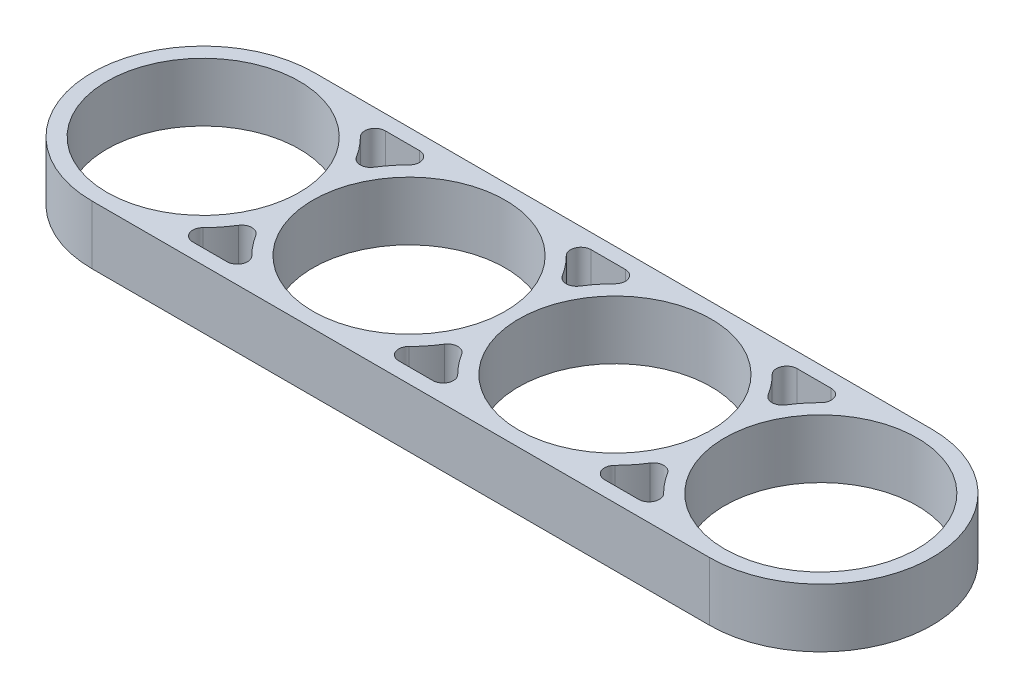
ISO-10303-21;
HEADER;
FILE_DESCRIPTION(('STEP AP214'),'2;1');
FILE_NAME('part.step','',(''),(''),'','','');
FILE_SCHEMA(('AUTOMOTIVE_DESIGN { 1 0 10303 214 1 1 1 1 }'));
ENDSEC;
DATA;
#1=APPLICATION_CONTEXT('core data for automotive mechanical design processes');
#2=APPLICATION_PROTOCOL_DEFINITION('international standard','automotive_design',2000,#1);
#3=PRODUCT_CONTEXT('',#1,'mechanical');
#4=PRODUCT('Part','Part','',(#3));
#5=PRODUCT_RELATED_PRODUCT_CATEGORY('part','',(#4));
#6=PRODUCT_DEFINITION_FORMATION('','',#4);
#7=PRODUCT_DEFINITION_CONTEXT('part definition',#1,'design');
#8=PRODUCT_DEFINITION('design','',#6,#7);
#9=PRODUCT_DEFINITION_SHAPE('','',#8);
#10=(LENGTH_UNIT() NAMED_UNIT(*) SI_UNIT(.MILLI.,.METRE.));
#11=(NAMED_UNIT(*) PLANE_ANGLE_UNIT() SI_UNIT($,.RADIAN.));
#12=(NAMED_UNIT(*) SI_UNIT($,.STERADIAN.) SOLID_ANGLE_UNIT());
#13=UNCERTAINTY_MEASURE_WITH_UNIT(LENGTH_MEASURE(1.E-05),#10,'distance_accuracy_value','');
#14=(GEOMETRIC_REPRESENTATION_CONTEXT(3) GLOBAL_UNCERTAINTY_ASSIGNED_CONTEXT((#13)) GLOBAL_UNIT_ASSIGNED_CONTEXT((#10,
#11,#12)) REPRESENTATION_CONTEXT('',''));
#15=CARTESIAN_POINT('',(0.,0.,0.));
#16=DIRECTION('',(0.,0.,1.));
#17=DIRECTION('',(1.,0.,0.));
#18=AXIS2_PLACEMENT_3D('',#15,#16,#17);
#19=CARTESIAN_POINT('',(-34.596637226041,5.7,0.));
#20=DIRECTION('',(0.,1.,0.));
#21=DIRECTION('',(0.,0.,1.));
#22=AXIS2_PLACEMENT_3D('',#19,#20,#21);
#23=PLANE('',#22);
#24=CARTESIAN_POINT('',(5.40336277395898,5.7,0.));
#25=DIRECTION('',(0.,1.,0.));
#26=DIRECTION('',(0.,0.,1.));
#27=AXIS2_PLACEMENT_3D('',#24,#25,#26);
#28=CIRCLE('',#27,9.35);
#29=CARTESIAN_POINT('',(5.40336277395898,5.7,9.35));
#30=VERTEX_POINT('',#29);
#31=EDGE_CURVE('E580',#30,#30,#28,.T.);
#32=ORIENTED_EDGE('',*,*,#31,.F.);
#33=EDGE_LOOP('',(#32));
#34=FACE_BOUND('',#33,.T.);
#35=CARTESIAN_POINT('',(-34.596637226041,5.7,0.));
#36=DIRECTION('',(0.,1.,0.));
#37=DIRECTION('',(0.,0.,1.));
#38=AXIS2_PLACEMENT_3D('',#35,#36,#37);
#39=CIRCLE('',#38,9.35);
#40=CARTESIAN_POINT('',(-34.596637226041,5.7,9.35));
#41=VERTEX_POINT('',#40);
#42=EDGE_CURVE('E592',#41,#41,#39,.T.);
#43=ORIENTED_EDGE('',*,*,#42,.F.);
#44=EDGE_LOOP('',(#43));
#45=FACE_BOUND('',#44,.T.);
#46=CARTESIAN_POINT('',(-34.596637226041,5.7,0.));
#47=DIRECTION('',(0.,1.,0.));
#48=DIRECTION('',(0.,0.,1.));
#49=AXIS2_PLACEMENT_3D('',#46,#47,#48);
#50=CIRCLE('',#49,10.8);
#51=CARTESIAN_POINT('',(-34.5966372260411,5.7,-10.8));
#52=VERTEX_POINT('',#51);
#53=CARTESIAN_POINT('',(-34.5966372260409,5.7,10.8));
#54=VERTEX_POINT('',#53);
#55=EDGE_CURVE('E598',#52,#54,#50,.T.);
#56=ORIENTED_EDGE('',*,*,#55,.T.);
#57=DIRECTION('',(1.,0.,0.));
#58=VECTOR('',#57,1.);
#59=CARTESIAN_POINT('',(-34.5966372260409,5.7,10.8));
#60=LINE('',#59,#58);
#61=CARTESIAN_POINT('',(25.4033627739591,5.7,10.8));
#62=VERTEX_POINT('',#61);
#63=EDGE_CURVE('E601',#54,#62,#60,.T.);
#64=ORIENTED_EDGE('',*,*,#63,.T.);
#65=CARTESIAN_POINT('',(25.403362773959,5.7,0.));
#66=DIRECTION('',(0.,1.,0.));
#67=DIRECTION('',(0.,0.,1.));
#68=AXIS2_PLACEMENT_3D('',#65,#66,#67);
#69=CIRCLE('',#68,10.8);
#70=CARTESIAN_POINT('',(25.4033627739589,5.7,-10.8));
#71=VERTEX_POINT('',#70);
#72=EDGE_CURVE('E604',#62,#71,#69,.T.);
#73=ORIENTED_EDGE('',*,*,#72,.T.);
#74=DIRECTION('',(-1.,0.,0.));
#75=VECTOR('',#74,1.);
#76=CARTESIAN_POINT('',(-34.5966372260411,5.7,-10.8));
#77=LINE('',#76,#75);
#78=EDGE_CURVE('E606',#71,#52,#77,.T.);
#79=ORIENTED_EDGE('',*,*,#78,.T.);
#80=EDGE_LOOP('',(#56,#64,#73,#79));
#81=FACE_BOUND('',#80,.T.);
#82=CARTESIAN_POINT('',(-14.596637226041,5.7,0.));
#83=DIRECTION('',(0.,1.,0.));
#84=DIRECTION('',(0.,0.,1.));
#85=AXIS2_PLACEMENT_3D('',#82,#83,#84);
#86=CIRCLE('',#85,9.35);
#87=CARTESIAN_POINT('',(-14.596637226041,5.7,9.35));
#88=VERTEX_POINT('',#87);
#89=EDGE_CURVE('E586',#88,#88,#86,.T.);
#90=ORIENTED_EDGE('',*,*,#89,.F.);
#91=EDGE_LOOP('',(#90));
#92=FACE_BOUND('',#91,.T.);
#93=CARTESIAN_POINT('',(25.403362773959,5.7,0.));
#94=DIRECTION('',(0.,1.,0.));
#95=DIRECTION('',(0.,0.,1.));
#96=AXIS2_PLACEMENT_3D('',#93,#94,#95);
#97=CIRCLE('',#96,9.34999999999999);
#98=CARTESIAN_POINT('',(25.403362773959,5.7,9.34999999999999));
#99=VERTEX_POINT('',#98);
#100=EDGE_CURVE('E574',#99,#99,#97,.T.);
#101=ORIENTED_EDGE('',*,*,#100,.F.);
#102=EDGE_LOOP('',(#101));
#103=FACE_BOUND('',#102,.T.);
#104=DIRECTION('',(1.,0.,0.));
#105=VECTOR('',#104,1.);
#106=CARTESIAN_POINT('',(-26.258921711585,5.7,9.35));
#107=LINE('',#106,#105);
#108=CARTESIAN_POINT('',(-26.258921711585,5.7,9.35));
#109=VERTEX_POINT('',#108);
#110=CARTESIAN_POINT('',(-22.934352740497,5.7,9.34999999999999));
#111=VERTEX_POINT('',#110);
#112=EDGE_CURVE('E531',#109,#111,#107,.T.);
#113=ORIENTED_EDGE('',*,*,#112,.F.);
#114=CARTESIAN_POINT('',(-26.258921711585,5.7,8.35));
#115=DIRECTION('',(0.,1.,0.));
#116=DIRECTION('',(0.,0.,-1.));
#117=AXIS2_PLACEMENT_3D('',#114,#115,#116);
#118=CIRCLE('',#117,1.);
#119=CARTESIAN_POINT('',(-26.9655077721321,5.7,7.64237288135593));
#120=VERTEX_POINT('',#119);
#121=EDGE_CURVE('E529',#120,#109,#118,.T.);
#122=ORIENTED_EDGE('',*,*,#121,.F.);
#123=CARTESIAN_POINT('',(-34.596637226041,5.7,0.));
#124=DIRECTION('',(0.,-1.,0.));
#125=DIRECTION('',(0.,0.,1.));
#126=AXIS2_PLACEMENT_3D('',#123,#124,#125);
#127=CIRCLE('',#126,10.8);
#128=CARTESIAN_POINT('',(-25.4440948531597,5.7,5.73332086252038));
#129=VERTEX_POINT('',#128);
#130=EDGE_CURVE('E541',#129,#120,#127,.T.);
#131=ORIENTED_EDGE('',*,*,#130,.F.);
#132=CARTESIAN_POINT('',(-24.596637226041,5.7,6.26418390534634));
#133=DIRECTION('',(0.,1.,0.));
#134=DIRECTION('',(0.,0.,1.));
#135=AXIS2_PLACEMENT_3D('',#132,#133,#134);
#136=CIRCLE('',#135,1.);
#137=CARTESIAN_POINT('',(-23.7491795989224,5.7,5.73332086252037));
#138=VERTEX_POINT('',#137);
#139=EDGE_CURVE('E538',#138,#129,#136,.T.);
#140=ORIENTED_EDGE('',*,*,#139,.F.);
#141=CARTESIAN_POINT('',(-14.596637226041,5.7,0.));
#142=DIRECTION('',(0.,-1.,0.));
#143=DIRECTION('',(0.,0.,1.));
#144=AXIS2_PLACEMENT_3D('',#141,#142,#143);
#145=CIRCLE('',#144,10.8);
#146=CARTESIAN_POINT('',(-22.2277666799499,5.7,7.64237288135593));
#147=VERTEX_POINT('',#146);
#148=EDGE_CURVE('E536',#147,#138,#145,.T.);
#149=ORIENTED_EDGE('',*,*,#148,.F.);
#150=CARTESIAN_POINT('',(-22.934352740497,5.7,8.34999999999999));
#151=DIRECTION('',(0.,1.,0.));
#152=DIRECTION('',(0.,0.,1.));
#153=AXIS2_PLACEMENT_3D('',#150,#151,#152);
#154=CIRCLE('',#153,1.);
#155=EDGE_CURVE('E534',#111,#147,#154,.T.);
#156=ORIENTED_EDGE('',*,*,#155,.F.);
#157=EDGE_LOOP('',(#113,#122,#131,#140,#149,#156));
#158=FACE_BOUND('',#157,.T.);
#159=DIRECTION('',(1.,0.,0.));
#160=VECTOR('',#159,1.);
#161=CARTESIAN_POINT('',(-6.25892171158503,5.7,9.34999999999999));
#162=LINE('',#161,#160);
#163=CARTESIAN_POINT('',(-6.25892171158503,5.7,9.34999999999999));
#164=VERTEX_POINT('',#163);
#165=CARTESIAN_POINT('',(-2.93435274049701,5.7,9.34999999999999));
#166=VERTEX_POINT('',#165);
#167=EDGE_CURVE('E486',#164,#166,#162,.T.);
#168=ORIENTED_EDGE('',*,*,#167,.F.);
#169=CARTESIAN_POINT('',(-6.25892171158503,5.7,8.34999999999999));
#170=DIRECTION('',(0.,1.,0.));
#171=DIRECTION('',(0.,0.,-1.));
#172=AXIS2_PLACEMENT_3D('',#169,#170,#171);
#173=CIRCLE('',#172,1.);
#174=CARTESIAN_POINT('',(-6.96550777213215,5.7,7.64237288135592));
#175=VERTEX_POINT('',#174);
#176=EDGE_CURVE('E484',#175,#164,#173,.T.);
#177=ORIENTED_EDGE('',*,*,#176,.F.);
#178=CARTESIAN_POINT('',(-14.596637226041,5.7,0.));
#179=DIRECTION('',(0.,-1.,0.));
#180=DIRECTION('',(0.,0.,1.));
#181=AXIS2_PLACEMENT_3D('',#178,#179,#180);
#182=CIRCLE('',#181,10.8);
#183=CARTESIAN_POINT('',(-5.44409485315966,5.7,5.73332086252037));
#184=VERTEX_POINT('',#183);
#185=EDGE_CURVE('E496',#184,#175,#182,.T.);
#186=ORIENTED_EDGE('',*,*,#185,.F.);
#187=CARTESIAN_POINT('',(-4.59663722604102,5.7,6.26418390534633));
#188=DIRECTION('',(0.,1.,0.));
#189=DIRECTION('',(0.,0.,1.));
#190=AXIS2_PLACEMENT_3D('',#187,#188,#189);
#191=CIRCLE('',#190,1.);
#192=CARTESIAN_POINT('',(-3.74917959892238,5.7,5.73332086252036));
#193=VERTEX_POINT('',#192);
#194=EDGE_CURVE('E493',#193,#184,#191,.T.);
#195=ORIENTED_EDGE('',*,*,#194,.F.);
#196=CARTESIAN_POINT('',(5.40336277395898,5.7,0.));
#197=DIRECTION('',(0.,-1.,0.));
#198=DIRECTION('',(0.,0.,1.));
#199=AXIS2_PLACEMENT_3D('',#196,#197,#198);
#200=CIRCLE('',#199,10.8);
#201=CARTESIAN_POINT('',(-2.22776667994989,5.7,7.64237288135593));
#202=VERTEX_POINT('',#201);
#203=EDGE_CURVE('E491',#202,#193,#200,.T.);
#204=ORIENTED_EDGE('',*,*,#203,.F.);
#205=CARTESIAN_POINT('',(-2.93435274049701,5.7,8.34999999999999));
#206=DIRECTION('',(0.,1.,0.));
#207=DIRECTION('',(0.,0.,1.));
#208=AXIS2_PLACEMENT_3D('',#205,#206,#207);
#209=CIRCLE('',#208,1.);
#210=EDGE_CURVE('E489',#166,#202,#209,.T.);
#211=ORIENTED_EDGE('',*,*,#210,.F.);
#212=EDGE_LOOP('',(#168,#177,#186,#195,#204,#211));
#213=FACE_BOUND('',#212,.T.);
#214=DIRECTION('',(1.,0.,0.));
#215=VECTOR('',#214,1.);
#216=CARTESIAN_POINT('',(13.741078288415,5.7,9.34999999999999));
#217=LINE('',#216,#215);
#218=CARTESIAN_POINT('',(13.741078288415,5.7,9.34999999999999));
#219=VERTEX_POINT('',#218);
#220=CARTESIAN_POINT('',(17.065647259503,5.7,9.34999999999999));
#221=VERTEX_POINT('',#220);
#222=EDGE_CURVE('E441',#219,#221,#217,.T.);
#223=ORIENTED_EDGE('',*,*,#222,.F.);
#224=CARTESIAN_POINT('',(13.741078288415,5.7,8.34999999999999));
#225=DIRECTION('',(0.,1.,0.));
#226=DIRECTION('',(0.,0.,-1.));
#227=AXIS2_PLACEMENT_3D('',#224,#225,#226);
#228=CIRCLE('',#227,1.);
#229=CARTESIAN_POINT('',(13.0344922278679,5.7,7.64237288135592));
#230=VERTEX_POINT('',#229);
#231=EDGE_CURVE('E439',#230,#219,#228,.T.);
#232=ORIENTED_EDGE('',*,*,#231,.F.);
#233=CARTESIAN_POINT('',(5.40336277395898,5.7,0.));
#234=DIRECTION('',(0.,-1.,0.));
#235=DIRECTION('',(0.,0.,1.));
#236=AXIS2_PLACEMENT_3D('',#233,#234,#235);
#237=CIRCLE('',#236,10.8);
#238=CARTESIAN_POINT('',(14.5559051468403,5.7,5.73332086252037));
#239=VERTEX_POINT('',#238);
#240=EDGE_CURVE('E451',#239,#230,#237,.T.);
#241=ORIENTED_EDGE('',*,*,#240,.F.);
#242=CARTESIAN_POINT('',(15.403362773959,5.7,6.26418390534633));
#243=DIRECTION('',(0.,1.,0.));
#244=DIRECTION('',(0.,0.,1.));
#245=AXIS2_PLACEMENT_3D('',#242,#243,#244);
#246=CIRCLE('',#245,1.);
#247=CARTESIAN_POINT('',(16.2508204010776,5.7,5.73332086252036));
#248=VERTEX_POINT('',#247);
#249=EDGE_CURVE('E448',#248,#239,#246,.T.);
#250=ORIENTED_EDGE('',*,*,#249,.F.);
#251=CARTESIAN_POINT('',(25.403362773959,5.7,0.));
#252=DIRECTION('',(0.,-1.,0.));
#253=DIRECTION('',(0.,0.,1.));
#254=AXIS2_PLACEMENT_3D('',#251,#252,#253);
#255=CIRCLE('',#254,10.8);
#256=CARTESIAN_POINT('',(17.7722333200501,5.7,7.64237288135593));
#257=VERTEX_POINT('',#256);
#258=EDGE_CURVE('E446',#257,#248,#255,.T.);
#259=ORIENTED_EDGE('',*,*,#258,.F.);
#260=CARTESIAN_POINT('',(17.065647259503,5.7,8.34999999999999));
#261=DIRECTION('',(0.,1.,0.));
#262=DIRECTION('',(0.,0.,1.));
#263=AXIS2_PLACEMENT_3D('',#260,#261,#262);
#264=CIRCLE('',#263,1.);
#265=EDGE_CURVE('E444',#221,#257,#264,.T.);
#266=ORIENTED_EDGE('',*,*,#265,.F.);
#267=EDGE_LOOP('',(#223,#232,#241,#250,#259,#266));
#268=FACE_BOUND('',#267,.T.);
#269=CARTESIAN_POINT('',(25.403362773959,5.7,0.));
#270=DIRECTION('',(0.,-1.,0.));
#271=DIRECTION('',(0.,0.,1.));
#272=AXIS2_PLACEMENT_3D('',#269,#270,#271);
#273=CIRCLE('',#272,10.8);
#274=CARTESIAN_POINT('',(16.2508204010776,5.7,-5.73332086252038));
#275=VERTEX_POINT('',#274);
#276=CARTESIAN_POINT('',(17.7722333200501,5.7,-7.64237288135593));
#277=VERTEX_POINT('',#276);
#278=EDGE_CURVE('E396',#275,#277,#273,.T.);
#279=ORIENTED_EDGE('',*,*,#278,.F.);
#280=CARTESIAN_POINT('',(15.403362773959,5.7,-6.26418390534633));
#281=DIRECTION('',(0.,1.,0.));
#282=DIRECTION('',(0.,0.,-1.));
#283=AXIS2_PLACEMENT_3D('',#280,#281,#282);
#284=CIRCLE('',#283,1.);
#285=CARTESIAN_POINT('',(14.5559051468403,5.7,-5.73332086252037));
#286=VERTEX_POINT('',#285);
#287=EDGE_CURVE('E394',#286,#275,#284,.T.);
#288=ORIENTED_EDGE('',*,*,#287,.F.);
#289=CARTESIAN_POINT('',(5.40336277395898,5.7,0.));
#290=DIRECTION('',(0.,-1.,0.));
#291=DIRECTION('',(0.,0.,1.));
#292=AXIS2_PLACEMENT_3D('',#289,#290,#291);
#293=CIRCLE('',#292,10.8);
#294=CARTESIAN_POINT('',(13.0344922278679,5.7,-7.64237288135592));
#295=VERTEX_POINT('',#294);
#296=EDGE_CURVE('E406',#295,#286,#293,.T.);
#297=ORIENTED_EDGE('',*,*,#296,.F.);
#298=CARTESIAN_POINT('',(13.741078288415,5.7,-8.34999999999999));
#299=DIRECTION('',(0.,1.,0.));
#300=DIRECTION('',(0.,0.,-1.));
#301=AXIS2_PLACEMENT_3D('',#298,#299,#300);
#302=CIRCLE('',#301,1.);
#303=CARTESIAN_POINT('',(13.741078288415,5.7,-9.34999999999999));
#304=VERTEX_POINT('',#303);
#305=EDGE_CURVE('E403',#304,#295,#302,.T.);
#306=ORIENTED_EDGE('',*,*,#305,.F.);
#307=DIRECTION('',(-1.,0.,0.));
#308=VECTOR('',#307,1.);
#309=CARTESIAN_POINT('',(13.741078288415,5.7,-9.34999999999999));
#310=LINE('',#309,#308);
#311=CARTESIAN_POINT('',(17.065647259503,5.7,-9.34999999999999));
#312=VERTEX_POINT('',#311);
#313=EDGE_CURVE('E401',#312,#304,#310,.T.);
#314=ORIENTED_EDGE('',*,*,#313,.F.);
#315=CARTESIAN_POINT('',(17.065647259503,5.7,-8.34999999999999));
#316=DIRECTION('',(0.,1.,0.));
#317=DIRECTION('',(0.,0.,1.));
#318=AXIS2_PLACEMENT_3D('',#315,#316,#317);
#319=CIRCLE('',#318,1.);
#320=EDGE_CURVE('E399',#277,#312,#319,.T.);
#321=ORIENTED_EDGE('',*,*,#320,.F.);
#322=EDGE_LOOP('',(#279,#288,#297,#306,#314,#321));
#323=FACE_BOUND('',#322,.T.);
#324=CARTESIAN_POINT('',(5.40336277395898,5.7,0.));
#325=DIRECTION('',(0.,-1.,0.));
#326=DIRECTION('',(0.,0.,1.));
#327=AXIS2_PLACEMENT_3D('',#324,#325,#326);
#328=CIRCLE('',#327,10.8);
#329=CARTESIAN_POINT('',(-3.74917959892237,5.7,-5.73332086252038));
#330=VERTEX_POINT('',#329);
#331=CARTESIAN_POINT('',(-2.22776667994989,5.7,-7.64237288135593));
#332=VERTEX_POINT('',#331);
#333=EDGE_CURVE('E351',#330,#332,#328,.T.);
#334=ORIENTED_EDGE('',*,*,#333,.F.);
#335=CARTESIAN_POINT('',(-4.59663722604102,5.7,-6.26418390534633));
#336=DIRECTION('',(0.,1.,0.));
#337=DIRECTION('',(0.,0.,1.));
#338=AXIS2_PLACEMENT_3D('',#335,#336,#337);
#339=CIRCLE('',#338,1.);
#340=CARTESIAN_POINT('',(-5.44409485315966,5.7,-5.73332086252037));
#341=VERTEX_POINT('',#340);
#342=EDGE_CURVE('E349',#341,#330,#339,.T.);
#343=ORIENTED_EDGE('',*,*,#342,.F.);
#344=CARTESIAN_POINT('',(-14.596637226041,5.7,0.));
#345=DIRECTION('',(0.,-1.,0.));
#346=DIRECTION('',(0.,0.,1.));
#347=AXIS2_PLACEMENT_3D('',#344,#345,#346);
#348=CIRCLE('',#347,10.8);
#349=CARTESIAN_POINT('',(-6.96550777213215,5.7,-7.64237288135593));
#350=VERTEX_POINT('',#349);
#351=EDGE_CURVE('E361',#350,#341,#348,.T.);
#352=ORIENTED_EDGE('',*,*,#351,.F.);
#353=CARTESIAN_POINT('',(-6.25892171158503,5.7,-8.34999999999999));
#354=DIRECTION('',(0.,1.,0.));
#355=DIRECTION('',(0.,0.,-1.));
#356=AXIS2_PLACEMENT_3D('',#353,#354,#355);
#357=CIRCLE('',#356,1.);
#358=CARTESIAN_POINT('',(-6.25892171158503,5.7,-9.34999999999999));
#359=VERTEX_POINT('',#358);
#360=EDGE_CURVE('E358',#359,#350,#357,.T.);
#361=ORIENTED_EDGE('',*,*,#360,.F.);
#362=DIRECTION('',(-1.,0.,0.));
#363=VECTOR('',#362,1.);
#364=CARTESIAN_POINT('',(-6.25892171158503,5.7,-9.34999999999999));
#365=LINE('',#364,#363);
#366=CARTESIAN_POINT('',(-2.93435274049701,5.7,-9.34999999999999));
#367=VERTEX_POINT('',#366);
#368=EDGE_CURVE('E356',#367,#359,#365,.T.);
#369=ORIENTED_EDGE('',*,*,#368,.F.);
#370=CARTESIAN_POINT('',(-2.93435274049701,5.7,-8.34999999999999));
#371=DIRECTION('',(0.,1.,0.));
#372=DIRECTION('',(0.,0.,1.));
#373=AXIS2_PLACEMENT_3D('',#370,#371,#372);
#374=CIRCLE('',#373,1.);
#375=EDGE_CURVE('E354',#332,#367,#374,.T.);
#376=ORIENTED_EDGE('',*,*,#375,.F.);
#377=EDGE_LOOP('',(#334,#343,#352,#361,#369,#376));
#378=FACE_BOUND('',#377,.T.);
#379=CARTESIAN_POINT('',(-14.596637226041,5.7,0.));
#380=DIRECTION('',(0.,-1.,0.));
#381=DIRECTION('',(0.,0.,1.));
#382=AXIS2_PLACEMENT_3D('',#379,#380,#381);
#383=CIRCLE('',#382,10.8);
#384=CARTESIAN_POINT('',(-23.7491795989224,5.7,-5.73332086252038));
#385=VERTEX_POINT('',#384);
#386=CARTESIAN_POINT('',(-22.2277666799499,5.7,-7.64237288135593));
#387=VERTEX_POINT('',#386);
#388=EDGE_CURVE('E306',#385,#387,#383,.T.);
#389=ORIENTED_EDGE('',*,*,#388,.F.);
#390=CARTESIAN_POINT('',(-24.596637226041,5.7,-6.26418390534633));
#391=DIRECTION('',(0.,1.,0.));
#392=DIRECTION('',(0.,0.,1.));
#393=AXIS2_PLACEMENT_3D('',#390,#391,#392);
#394=CIRCLE('',#393,1.);
#395=CARTESIAN_POINT('',(-25.4440948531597,5.7,-5.73332086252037));
#396=VERTEX_POINT('',#395);
#397=EDGE_CURVE('E298',#396,#385,#394,.T.);
#398=ORIENTED_EDGE('',*,*,#397,.F.);
#399=CARTESIAN_POINT('',(-34.596637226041,5.7,0.));
#400=DIRECTION('',(0.,-1.,0.));
#401=DIRECTION('',(0.,0.,1.));
#402=AXIS2_PLACEMENT_3D('',#399,#400,#401);
#403=CIRCLE('',#402,10.8);
#404=CARTESIAN_POINT('',(-26.9655077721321,5.7,-7.64237288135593));
#405=VERTEX_POINT('',#404);
#406=EDGE_CURVE('E327',#405,#396,#403,.T.);
#407=ORIENTED_EDGE('',*,*,#406,.F.);
#408=CARTESIAN_POINT('',(-26.258921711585,5.7,-8.35));
#409=DIRECTION('',(0.,1.,0.));
#410=DIRECTION('',(0.,0.,1.));
#411=AXIS2_PLACEMENT_3D('',#408,#409,#410);
#412=CIRCLE('',#411,1.);
#413=CARTESIAN_POINT('',(-26.258921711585,5.7,-9.35));
#414=VERTEX_POINT('',#413);
#415=EDGE_CURVE('E325',#414,#405,#412,.T.);
#416=ORIENTED_EDGE('',*,*,#415,.F.);
#417=DIRECTION('',(-1.,0.,0.));
#418=VECTOR('',#417,1.);
#419=CARTESIAN_POINT('',(-26.258921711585,5.7,-9.35));
#420=LINE('',#419,#418);
#421=CARTESIAN_POINT('',(-22.934352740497,5.7,-9.34999999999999));
#422=VERTEX_POINT('',#421);
#423=EDGE_CURVE('E321',#422,#414,#420,.T.);
#424=ORIENTED_EDGE('',*,*,#423,.F.);
#425=CARTESIAN_POINT('',(-22.934352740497,5.7,-8.34999999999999));
#426=DIRECTION('',(0.,1.,0.));
#427=DIRECTION('',(0.,0.,1.));
#428=AXIS2_PLACEMENT_3D('',#425,#426,#427);
#429=CIRCLE('',#428,1.);
#430=EDGE_CURVE('E319',#387,#422,#429,.T.);
#431=ORIENTED_EDGE('',*,*,#430,.F.);
#432=EDGE_LOOP('',(#389,#398,#407,#416,#424,#431));
#433=FACE_BOUND('',#432,.T.);
#434=ADVANCED_FACE('F41',(#34,#45,#81,#92,#103,#158,#213,#268,#323,#378,#433),#23,.T.);
#435=CARTESIAN_POINT('',(-34.596637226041,0.,0.));
#436=DIRECTION('',(0.,1.,0.));
#437=DIRECTION('',(0.,0.,1.));
#438=AXIS2_PLACEMENT_3D('',#435,#436,#437);
#439=PLANE('',#438);
#440=CARTESIAN_POINT('',(-4.59663722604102,0.,-6.26418390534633));
#441=DIRECTION('',(0.,1.,0.));
#442=DIRECTION('',(0.,0.,1.));
#443=AXIS2_PLACEMENT_3D('',#440,#441,#442);
#444=CIRCLE('',#443,1.);
#445=CARTESIAN_POINT('',(-5.44409485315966,0.,-5.73332086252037));
#446=VERTEX_POINT('',#445);
#447=CARTESIAN_POINT('',(-3.74917959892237,0.,-5.73332086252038));
#448=VERTEX_POINT('',#447);
#449=EDGE_CURVE('E314',#446,#448,#444,.T.);
#450=ORIENTED_EDGE('',*,*,#449,.T.);
#451=CARTESIAN_POINT('',(5.40336277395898,0.,0.));
#452=DIRECTION('',(0.,-1.,0.));
#453=DIRECTION('',(0.,0.,1.));
#454=AXIS2_PLACEMENT_3D('',#451,#452,#453);
#455=CIRCLE('',#454,10.8);
#456=CARTESIAN_POINT('',(-2.22776667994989,0.,-7.64237288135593));
#457=VERTEX_POINT('',#456);
#458=EDGE_CURVE('E366',#448,#457,#455,.T.);
#459=ORIENTED_EDGE('',*,*,#458,.T.);
#460=CARTESIAN_POINT('',(-2.93435274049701,0.,-8.34999999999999));
#461=DIRECTION('',(0.,1.,0.));
#462=DIRECTION('',(0.,0.,1.));
#463=AXIS2_PLACEMENT_3D('',#460,#461,#462);
#464=CIRCLE('',#463,1.);
#465=CARTESIAN_POINT('',(-2.93435274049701,0.,-9.34999999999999));
#466=VERTEX_POINT('',#465);
#467=EDGE_CURVE('E369',#457,#466,#464,.T.);
#468=ORIENTED_EDGE('',*,*,#467,.T.);
#469=DIRECTION('',(-1.,0.,0.));
#470=VECTOR('',#469,1.);
#471=CARTESIAN_POINT('',(-6.25892171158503,0.,-9.34999999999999));
#472=LINE('',#471,#470);
#473=CARTESIAN_POINT('',(-6.25892171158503,0.,-9.34999999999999));
#474=VERTEX_POINT('',#473);
#475=EDGE_CURVE('E372',#466,#474,#472,.T.);
#476=ORIENTED_EDGE('',*,*,#475,.T.);
#477=CARTESIAN_POINT('',(-6.25892171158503,0.,-8.34999999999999));
#478=DIRECTION('',(0.,1.,0.));
#479=DIRECTION('',(0.,0.,-1.));
#480=AXIS2_PLACEMENT_3D('',#477,#478,#479);
#481=CIRCLE('',#480,1.);
#482=CARTESIAN_POINT('',(-6.96550777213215,0.,-7.64237288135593));
#483=VERTEX_POINT('',#482);
#484=EDGE_CURVE('E375',#474,#483,#481,.T.);
#485=ORIENTED_EDGE('',*,*,#484,.T.);
#486=CARTESIAN_POINT('',(-14.596637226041,0.,0.));
#487=DIRECTION('',(0.,-1.,0.));
#488=DIRECTION('',(0.,0.,1.));
#489=AXIS2_PLACEMENT_3D('',#486,#487,#488);
#490=CIRCLE('',#489,10.8);
#491=EDGE_CURVE('E352',#483,#446,#490,.T.);
#492=ORIENTED_EDGE('',*,*,#491,.T.);
#493=EDGE_LOOP('',(#450,#459,#468,#476,#485,#492));
#494=FACE_BOUND('',#493,.T.);
#495=CARTESIAN_POINT('',(13.741078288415,0.,8.34999999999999));
#496=DIRECTION('',(0.,1.,0.));
#497=DIRECTION('',(0.,0.,-1.));
#498=AXIS2_PLACEMENT_3D('',#495,#496,#497);
#499=CIRCLE('',#498,1.);
#500=CARTESIAN_POINT('',(13.0344922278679,0.,7.64237288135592));
#501=VERTEX_POINT('',#500);
#502=CARTESIAN_POINT('',(13.741078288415,0.,9.34999999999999));
#503=VERTEX_POINT('',#502);
#504=EDGE_CURVE('E438',#501,#503,#499,.T.);
#505=ORIENTED_EDGE('',*,*,#504,.T.);
#506=DIRECTION('',(1.,0.,0.));
#507=VECTOR('',#506,1.);
#508=CARTESIAN_POINT('',(13.741078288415,0.,9.34999999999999));
#509=LINE('',#508,#507);
#510=CARTESIAN_POINT('',(17.065647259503,0.,9.34999999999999));
#511=VERTEX_POINT('',#510);
#512=EDGE_CURVE('E456',#503,#511,#509,.T.);
#513=ORIENTED_EDGE('',*,*,#512,.T.);
#514=CARTESIAN_POINT('',(17.065647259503,0.,8.34999999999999));
#515=DIRECTION('',(0.,1.,0.));
#516=DIRECTION('',(0.,0.,1.));
#517=AXIS2_PLACEMENT_3D('',#514,#515,#516);
#518=CIRCLE('',#517,1.);
#519=CARTESIAN_POINT('',(17.7722333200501,0.,7.64237288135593));
#520=VERTEX_POINT('',#519);
#521=EDGE_CURVE('E459',#511,#520,#518,.T.);
#522=ORIENTED_EDGE('',*,*,#521,.T.);
#523=CARTESIAN_POINT('',(25.403362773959,0.,0.));
#524=DIRECTION('',(0.,-1.,0.));
#525=DIRECTION('',(0.,0.,1.));
#526=AXIS2_PLACEMENT_3D('',#523,#524,#525);
#527=CIRCLE('',#526,10.8);
#528=CARTESIAN_POINT('',(16.2508204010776,0.,5.73332086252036));
#529=VERTEX_POINT('',#528);
#530=EDGE_CURVE('E462',#520,#529,#527,.T.);
#531=ORIENTED_EDGE('',*,*,#530,.T.);
#532=CARTESIAN_POINT('',(15.403362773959,0.,6.26418390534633));
#533=DIRECTION('',(0.,1.,0.));
#534=DIRECTION('',(0.,0.,1.));
#535=AXIS2_PLACEMENT_3D('',#532,#533,#534);
#536=CIRCLE('',#535,1.);
#537=CARTESIAN_POINT('',(14.5559051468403,0.,5.73332086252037));
#538=VERTEX_POINT('',#537);
#539=EDGE_CURVE('E465',#529,#538,#536,.T.);
#540=ORIENTED_EDGE('',*,*,#539,.T.);
#541=CARTESIAN_POINT('',(5.40336277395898,0.,0.));
#542=DIRECTION('',(0.,-1.,0.));
#543=DIRECTION('',(0.,0.,1.));
#544=AXIS2_PLACEMENT_3D('',#541,#542,#543);
#545=CIRCLE('',#544,10.8);
#546=EDGE_CURVE('E442',#538,#501,#545,.T.);
#547=ORIENTED_EDGE('',*,*,#546,.T.);
#548=EDGE_LOOP('',(#505,#513,#522,#531,#540,#547));
#549=FACE_BOUND('',#548,.T.);
#550=CARTESIAN_POINT('',(-26.258921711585,0.,8.35));
#551=DIRECTION('',(0.,1.,0.));
#552=DIRECTION('',(0.,0.,-1.));
#553=AXIS2_PLACEMENT_3D('',#550,#551,#552);
#554=CIRCLE('',#553,1.);
#555=CARTESIAN_POINT('',(-26.9655077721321,0.,7.64237288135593));
#556=VERTEX_POINT('',#555);
#557=CARTESIAN_POINT('',(-26.258921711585,0.,9.35));
#558=VERTEX_POINT('',#557);
#559=EDGE_CURVE('E528',#556,#558,#554,.T.);
#560=ORIENTED_EDGE('',*,*,#559,.T.);
#561=DIRECTION('',(1.,0.,0.));
#562=VECTOR('',#561,1.);
#563=CARTESIAN_POINT('',(-26.258921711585,0.,9.35));
#564=LINE('',#563,#562);
#565=CARTESIAN_POINT('',(-22.934352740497,0.,9.34999999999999));
#566=VERTEX_POINT('',#565);
#567=EDGE_CURVE('E546',#558,#566,#564,.T.);
#568=ORIENTED_EDGE('',*,*,#567,.T.);
#569=CARTESIAN_POINT('',(-22.934352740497,0.,8.34999999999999));
#570=DIRECTION('',(0.,1.,0.));
#571=DIRECTION('',(0.,0.,1.));
#572=AXIS2_PLACEMENT_3D('',#569,#570,#571);
#573=CIRCLE('',#572,1.);
#574=CARTESIAN_POINT('',(-22.2277666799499,0.,7.64237288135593));
#575=VERTEX_POINT('',#574);
#576=EDGE_CURVE('E549',#566,#575,#573,.T.);
#577=ORIENTED_EDGE('',*,*,#576,.T.);
#578=CARTESIAN_POINT('',(-14.596637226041,0.,0.));
#579=DIRECTION('',(0.,-1.,0.));
#580=DIRECTION('',(0.,0.,1.));
#581=AXIS2_PLACEMENT_3D('',#578,#579,#580);
#582=CIRCLE('',#581,10.8);
#583=CARTESIAN_POINT('',(-23.7491795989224,0.,5.73332086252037));
#584=VERTEX_POINT('',#583);
#585=EDGE_CURVE('E552',#575,#584,#582,.T.);
#586=ORIENTED_EDGE('',*,*,#585,.T.);
#587=CARTESIAN_POINT('',(-24.596637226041,0.,6.26418390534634));
#588=DIRECTION('',(0.,1.,0.));
#589=DIRECTION('',(0.,0.,1.));
#590=AXIS2_PLACEMENT_3D('',#587,#588,#589);
#591=CIRCLE('',#590,1.);
#592=CARTESIAN_POINT('',(-25.4440948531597,0.,5.73332086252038));
#593=VERTEX_POINT('',#592);
#594=EDGE_CURVE('E555',#584,#593,#591,.T.);
#595=ORIENTED_EDGE('',*,*,#594,.T.);
#596=CARTESIAN_POINT('',(-34.596637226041,0.,0.));
#597=DIRECTION('',(0.,-1.,0.));
#598=DIRECTION('',(0.,0.,1.));
#599=AXIS2_PLACEMENT_3D('',#596,#597,#598);
#600=CIRCLE('',#599,10.8);
#601=EDGE_CURVE('E532',#593,#556,#600,.T.);
#602=ORIENTED_EDGE('',*,*,#601,.T.);
#603=EDGE_LOOP('',(#560,#568,#577,#586,#595,#602));
#604=FACE_BOUND('',#603,.T.);
#605=CARTESIAN_POINT('',(-34.596637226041,0.,0.));
#606=DIRECTION('',(0.,1.,0.));
#607=DIRECTION('',(0.,0.,1.));
#608=AXIS2_PLACEMENT_3D('',#605,#606,#607);
#609=CIRCLE('',#608,10.8);
#610=CARTESIAN_POINT('',(-34.5966372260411,0.,-10.8));
#611=VERTEX_POINT('',#610);
#612=CARTESIAN_POINT('',(-34.5966372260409,0.,10.8));
#613=VERTEX_POINT('',#612);
#614=EDGE_CURVE('E595',#611,#613,#609,.T.);
#615=ORIENTED_EDGE('',*,*,#614,.F.);
#616=DIRECTION('',(-1.,0.,0.));
#617=VECTOR('',#616,1.);
#618=CARTESIAN_POINT('',(-34.5966372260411,0.,-10.8));
#619=LINE('',#618,#617);
#620=CARTESIAN_POINT('',(25.4033627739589,0.,-10.8));
#621=VERTEX_POINT('',#620);
#622=EDGE_CURVE('E602',#621,#611,#619,.T.);
#623=ORIENTED_EDGE('',*,*,#622,.F.);
#624=CARTESIAN_POINT('',(25.403362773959,0.,0.));
#625=DIRECTION('',(0.,1.,0.));
#626=DIRECTION('',(0.,0.,1.));
#627=AXIS2_PLACEMENT_3D('',#624,#625,#626);
#628=CIRCLE('',#627,10.8);
#629=CARTESIAN_POINT('',(25.4033627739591,0.,10.8));
#630=VERTEX_POINT('',#629);
#631=EDGE_CURVE('E613',#630,#621,#628,.T.);
#632=ORIENTED_EDGE('',*,*,#631,.F.);
#633=DIRECTION('',(1.,0.,0.));
#634=VECTOR('',#633,1.);
#635=CARTESIAN_POINT('',(-34.5966372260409,0.,10.8));
#636=LINE('',#635,#634);
#637=EDGE_CURVE('E611',#613,#630,#636,.T.);
#638=ORIENTED_EDGE('',*,*,#637,.F.);
#639=EDGE_LOOP('',(#615,#623,#632,#638));
#640=FACE_BOUND('',#639,.T.);
#641=CARTESIAN_POINT('',(-34.596637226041,0.,0.));
#642=DIRECTION('',(0.,1.,0.));
#643=DIRECTION('',(0.,0.,1.));
#644=AXIS2_PLACEMENT_3D('',#641,#642,#643);
#645=CIRCLE('',#644,9.35);
#646=CARTESIAN_POINT('',(-34.596637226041,0.,9.35));
#647=VERTEX_POINT('',#646);
#648=EDGE_CURVE('E589',#647,#647,#645,.T.);
#649=ORIENTED_EDGE('',*,*,#648,.T.);
#650=EDGE_LOOP('',(#649));
#651=FACE_BOUND('',#650,.T.);
#652=CARTESIAN_POINT('',(-14.596637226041,0.,0.));
#653=DIRECTION('',(0.,1.,0.));
#654=DIRECTION('',(0.,0.,1.));
#655=AXIS2_PLACEMENT_3D('',#652,#653,#654);
#656=CIRCLE('',#655,9.35);
#657=CARTESIAN_POINT('',(-14.596637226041,0.,9.35));
#658=VERTEX_POINT('',#657);
#659=EDGE_CURVE('E583',#658,#658,#656,.T.);
#660=ORIENTED_EDGE('',*,*,#659,.T.);
#661=EDGE_LOOP('',(#660));
#662=FACE_BOUND('',#661,.T.);
#663=CARTESIAN_POINT('',(5.40336277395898,0.,0.));
#664=DIRECTION('',(0.,1.,0.));
#665=DIRECTION('',(0.,0.,1.));
#666=AXIS2_PLACEMENT_3D('',#663,#664,#665);
#667=CIRCLE('',#666,9.35);
#668=CARTESIAN_POINT('',(5.40336277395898,0.,9.35));
#669=VERTEX_POINT('',#668);
#670=EDGE_CURVE('E577',#669,#669,#667,.T.);
#671=ORIENTED_EDGE('',*,*,#670,.T.);
#672=EDGE_LOOP('',(#671));
#673=FACE_BOUND('',#672,.T.);
#674=CARTESIAN_POINT('',(25.403362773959,0.,0.));
#675=DIRECTION('',(0.,1.,0.));
#676=DIRECTION('',(0.,0.,1.));
#677=AXIS2_PLACEMENT_3D('',#674,#675,#676);
#678=CIRCLE('',#677,9.34999999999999);
#679=CARTESIAN_POINT('',(25.403362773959,0.,9.34999999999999));
#680=VERTEX_POINT('',#679);
#681=EDGE_CURVE('E573',#680,#680,#678,.T.);
#682=ORIENTED_EDGE('',*,*,#681,.T.);
#683=EDGE_LOOP('',(#682));
#684=FACE_BOUND('',#683,.T.);
#685=CARTESIAN_POINT('',(-6.25892171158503,0.,8.34999999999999));
#686=DIRECTION('',(0.,1.,0.));
#687=DIRECTION('',(0.,0.,-1.));
#688=AXIS2_PLACEMENT_3D('',#685,#686,#687);
#689=CIRCLE('',#688,1.);
#690=CARTESIAN_POINT('',(-6.96550777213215,0.,7.64237288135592));
#691=VERTEX_POINT('',#690);
#692=CARTESIAN_POINT('',(-6.25892171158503,0.,9.34999999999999));
#693=VERTEX_POINT('',#692);
#694=EDGE_CURVE('E483',#691,#693,#689,.T.);
#695=ORIENTED_EDGE('',*,*,#694,.T.);
#696=DIRECTION('',(1.,0.,0.));
#697=VECTOR('',#696,1.);
#698=CARTESIAN_POINT('',(-6.25892171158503,0.,9.34999999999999));
#699=LINE('',#698,#697);
#700=CARTESIAN_POINT('',(-2.93435274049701,0.,9.34999999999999));
#701=VERTEX_POINT('',#700);
#702=EDGE_CURVE('E501',#693,#701,#699,.T.);
#703=ORIENTED_EDGE('',*,*,#702,.T.);
#704=CARTESIAN_POINT('',(-2.93435274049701,0.,8.34999999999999));
#705=DIRECTION('',(0.,1.,0.));
#706=DIRECTION('',(0.,0.,1.));
#707=AXIS2_PLACEMENT_3D('',#704,#705,#706);
#708=CIRCLE('',#707,1.);
#709=CARTESIAN_POINT('',(-2.22776667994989,0.,7.64237288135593));
#710=VERTEX_POINT('',#709);
#711=EDGE_CURVE('E504',#701,#710,#708,.T.);
#712=ORIENTED_EDGE('',*,*,#711,.T.);
#713=CARTESIAN_POINT('',(5.40336277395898,0.,0.));
#714=DIRECTION('',(0.,-1.,0.));
#715=DIRECTION('',(0.,0.,1.));
#716=AXIS2_PLACEMENT_3D('',#713,#714,#715);
#717=CIRCLE('',#716,10.8);
#718=CARTESIAN_POINT('',(-3.74917959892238,0.,5.73332086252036));
#719=VERTEX_POINT('',#718);
#720=EDGE_CURVE('E507',#710,#719,#717,.T.);
#721=ORIENTED_EDGE('',*,*,#720,.T.);
#722=CARTESIAN_POINT('',(-4.59663722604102,0.,6.26418390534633));
#723=DIRECTION('',(0.,1.,0.));
#724=DIRECTION('',(0.,0.,1.));
#725=AXIS2_PLACEMENT_3D('',#722,#723,#724);
#726=CIRCLE('',#725,1.);
#727=CARTESIAN_POINT('',(-5.44409485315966,0.,5.73332086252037));
#728=VERTEX_POINT('',#727);
#729=EDGE_CURVE('E510',#719,#728,#726,.T.);
#730=ORIENTED_EDGE('',*,*,#729,.T.);
#731=CARTESIAN_POINT('',(-14.596637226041,0.,0.));
#732=DIRECTION('',(0.,-1.,0.));
#733=DIRECTION('',(0.,0.,1.));
#734=AXIS2_PLACEMENT_3D('',#731,#732,#733);
#735=CIRCLE('',#734,10.8);
#736=EDGE_CURVE('E487',#728,#691,#735,.T.);
#737=ORIENTED_EDGE('',*,*,#736,.T.);
#738=EDGE_LOOP('',(#695,#703,#712,#721,#730,#737));
#739=FACE_BOUND('',#738,.T.);
#740=CARTESIAN_POINT('',(15.403362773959,0.,-6.26418390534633));
#741=DIRECTION('',(0.,1.,0.));
#742=DIRECTION('',(0.,0.,-1.));
#743=AXIS2_PLACEMENT_3D('',#740,#741,#742);
#744=CIRCLE('',#743,1.);
#745=CARTESIAN_POINT('',(14.5559051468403,0.,-5.73332086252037));
#746=VERTEX_POINT('',#745);
#747=CARTESIAN_POINT('',(16.2508204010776,0.,-5.73332086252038));
#748=VERTEX_POINT('',#747);
#749=EDGE_CURVE('E393',#746,#748,#744,.T.);
#750=ORIENTED_EDGE('',*,*,#749,.T.);
#751=CARTESIAN_POINT('',(25.403362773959,0.,0.));
#752=DIRECTION('',(0.,-1.,0.));
#753=DIRECTION('',(0.,0.,1.));
#754=AXIS2_PLACEMENT_3D('',#751,#752,#753);
#755=CIRCLE('',#754,10.8);
#756=CARTESIAN_POINT('',(17.7722333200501,0.,-7.64237288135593));
#757=VERTEX_POINT('',#756);
#758=EDGE_CURVE('E411',#748,#757,#755,.T.);
#759=ORIENTED_EDGE('',*,*,#758,.T.);
#760=CARTESIAN_POINT('',(17.065647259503,0.,-8.34999999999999));
#761=DIRECTION('',(0.,1.,0.));
#762=DIRECTION('',(0.,0.,1.));
#763=AXIS2_PLACEMENT_3D('',#760,#761,#762);
#764=CIRCLE('',#763,1.);
#765=CARTESIAN_POINT('',(17.065647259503,0.,-9.34999999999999));
#766=VERTEX_POINT('',#765);
#767=EDGE_CURVE('E414',#757,#766,#764,.T.);
#768=ORIENTED_EDGE('',*,*,#767,.T.);
#769=DIRECTION('',(-1.,0.,0.));
#770=VECTOR('',#769,1.);
#771=CARTESIAN_POINT('',(13.741078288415,0.,-9.34999999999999));
#772=LINE('',#771,#770);
#773=CARTESIAN_POINT('',(13.741078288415,0.,-9.34999999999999));
#774=VERTEX_POINT('',#773);
#775=EDGE_CURVE('E417',#766,#774,#772,.T.);
#776=ORIENTED_EDGE('',*,*,#775,.T.);
#777=CARTESIAN_POINT('',(13.741078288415,0.,-8.34999999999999));
#778=DIRECTION('',(0.,1.,0.));
#779=DIRECTION('',(0.,0.,-1.));
#780=AXIS2_PLACEMENT_3D('',#777,#778,#779);
#781=CIRCLE('',#780,1.);
#782=CARTESIAN_POINT('',(13.0344922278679,0.,-7.64237288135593));
#783=VERTEX_POINT('',#782);
#784=EDGE_CURVE('E420',#774,#783,#781,.T.);
#785=ORIENTED_EDGE('',*,*,#784,.T.);
#786=CARTESIAN_POINT('',(5.40336277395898,0.,0.));
#787=DIRECTION('',(0.,-1.,0.));
#788=DIRECTION('',(0.,0.,1.));
#789=AXIS2_PLACEMENT_3D('',#786,#787,#788);
#790=CIRCLE('',#789,10.8);
#791=EDGE_CURVE('E397',#783,#746,#790,.T.);
#792=ORIENTED_EDGE('',*,*,#791,.T.);
#793=EDGE_LOOP('',(#750,#759,#768,#776,#785,#792));
#794=FACE_BOUND('',#793,.T.);
#795=CARTESIAN_POINT('',(-24.596637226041,0.,-6.26418390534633));
#796=DIRECTION('',(0.,1.,0.));
#797=DIRECTION('',(0.,0.,1.));
#798=AXIS2_PLACEMENT_3D('',#795,#796,#797);
#799=CIRCLE('',#798,1.);
#800=CARTESIAN_POINT('',(-25.4440948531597,0.,-5.73332086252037));
#801=VERTEX_POINT('',#800);
#802=CARTESIAN_POINT('',(-23.7491795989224,0.,-5.73332086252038));
#803=VERTEX_POINT('',#802);
#804=EDGE_CURVE('E64',#801,#803,#799,.T.);
#805=ORIENTED_EDGE('',*,*,#804,.T.);
#806=CARTESIAN_POINT('',(-14.596637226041,0.,0.));
#807=DIRECTION('',(0.,-1.,0.));
#808=DIRECTION('',(0.,0.,1.));
#809=AXIS2_PLACEMENT_3D('',#806,#807,#808);
#810=CIRCLE('',#809,10.8);
#811=CARTESIAN_POINT('',(-22.2277666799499,0.,-7.64237288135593));
#812=VERTEX_POINT('',#811);
#813=EDGE_CURVE('E313',#803,#812,#810,.T.);
#814=ORIENTED_EDGE('',*,*,#813,.T.);
#815=CARTESIAN_POINT('',(-22.934352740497,0.,-8.34999999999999));
#816=DIRECTION('',(0.,1.,0.));
#817=DIRECTION('',(0.,0.,1.));
#818=AXIS2_PLACEMENT_3D('',#815,#816,#817);
#819=CIRCLE('',#818,1.);
#820=CARTESIAN_POINT('',(-22.934352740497,0.,-9.34999999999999));
#821=VERTEX_POINT('',#820);
#822=EDGE_CURVE('E331',#812,#821,#819,.T.);
#823=ORIENTED_EDGE('',*,*,#822,.T.);
#824=DIRECTION('',(-1.,0.,0.));
#825=VECTOR('',#824,1.);
#826=CARTESIAN_POINT('',(-26.258921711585,0.,-9.35));
#827=LINE('',#826,#825);
#828=CARTESIAN_POINT('',(-26.258921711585,0.,-9.35));
#829=VERTEX_POINT('',#828);
#830=EDGE_CURVE('E334',#821,#829,#827,.T.);
#831=ORIENTED_EDGE('',*,*,#830,.T.);
#832=CARTESIAN_POINT('',(-26.258921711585,0.,-8.35));
#833=DIRECTION('',(0.,1.,0.));
#834=DIRECTION('',(0.,0.,1.));
#835=AXIS2_PLACEMENT_3D('',#832,#833,#834);
#836=CIRCLE('',#835,1.);
#837=CARTESIAN_POINT('',(-26.9655077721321,0.,-7.64237288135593));
#838=VERTEX_POINT('',#837);
#839=EDGE_CURVE('E337',#829,#838,#836,.T.);
#840=ORIENTED_EDGE('',*,*,#839,.T.);
#841=CARTESIAN_POINT('',(-34.596637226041,0.,0.));
#842=DIRECTION('',(0.,-1.,0.));
#843=DIRECTION('',(0.,0.,1.));
#844=AXIS2_PLACEMENT_3D('',#841,#842,#843);
#845=CIRCLE('',#844,10.8);
#846=EDGE_CURVE('E307',#838,#801,#845,.T.);
#847=ORIENTED_EDGE('',*,*,#846,.T.);
#848=EDGE_LOOP('',(#805,#814,#823,#831,#840,#847));
#849=FACE_BOUND('',#848,.T.);
#850=ADVANCED_FACE('F631',(#494,#549,#604,#640,#651,#662,#673,#684,#739,#794,#849),#439,.F.);
#851=CARTESIAN_POINT('',(-34.596637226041,5.7,0.));
#852=DIRECTION('',(0.,-1.,0.));
#853=DIRECTION('',(0.,0.,-1.));
#854=AXIS2_PLACEMENT_3D('',#851,#852,#853);
#855=CYLINDRICAL_SURFACE('',#854,10.8);
#856=ORIENTED_EDGE('',*,*,#614,.T.);
#857=DIRECTION('',(0.,-1.,0.));
#858=VECTOR('',#857,1.);
#859=CARTESIAN_POINT('',(-34.5966372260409,5.7,10.8));
#860=LINE('',#859,#858);
#861=EDGE_CURVE('E11',#54,#613,#860,.T.);
#862=ORIENTED_EDGE('',*,*,#861,.F.);
#863=ORIENTED_EDGE('',*,*,#55,.F.);
#864=DIRECTION('',(0.,-1.,0.));
#865=VECTOR('',#864,1.);
#866=CARTESIAN_POINT('',(-34.5966372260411,5.7,-10.8));
#867=LINE('',#866,#865);
#868=EDGE_CURVE('E608',#52,#611,#867,.T.);
#869=ORIENTED_EDGE('',*,*,#868,.T.);
#870=EDGE_LOOP('',(#856,#862,#863,#869));
#871=FACE_BOUND('',#870,.T.);
#872=ADVANCED_FACE('F43',(#871),#855,.T.);
#873=CARTESIAN_POINT('',(-34.5966372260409,5.7,10.8));
#874=DIRECTION('',(0.,0.,-1.));
#875=DIRECTION('',(-1.,0.,0.));
#876=AXIS2_PLACEMENT_3D('',#873,#874,#875);
#877=PLANE('',#876);
#878=ORIENTED_EDGE('',*,*,#637,.T.);
#879=DIRECTION('',(0.,-1.,0.));
#880=VECTOR('',#879,1.);
#881=CARTESIAN_POINT('',(25.4033627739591,5.7,10.8));
#882=LINE('',#881,#880);
#883=EDGE_CURVE('E49',#62,#630,#882,.T.);
#884=ORIENTED_EDGE('',*,*,#883,.F.);
#885=ORIENTED_EDGE('',*,*,#63,.F.);
#886=ORIENTED_EDGE('',*,*,#861,.T.);
#887=EDGE_LOOP('',(#878,#884,#885,#886));
#888=FACE_BOUND('',#887,.T.);
#889=ADVANCED_FACE('F642',(#888),#877,.F.);
#890=CARTESIAN_POINT('',(25.403362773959,5.7,0.));
#891=DIRECTION('',(0.,-1.,0.));
#892=DIRECTION('',(0.,0.,-1.));
#893=AXIS2_PLACEMENT_3D('',#890,#891,#892);
#894=CYLINDRICAL_SURFACE('',#893,10.8);
#895=ORIENTED_EDGE('',*,*,#631,.T.);
#896=DIRECTION('',(0.,-1.,0.));
#897=VECTOR('',#896,1.);
#898=CARTESIAN_POINT('',(25.4033627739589,5.7,-10.8));
#899=LINE('',#898,#897);
#900=EDGE_CURVE('E618',#71,#621,#899,.T.);
#901=ORIENTED_EDGE('',*,*,#900,.F.);
#902=ORIENTED_EDGE('',*,*,#72,.F.);
#903=ORIENTED_EDGE('',*,*,#883,.T.);
#904=EDGE_LOOP('',(#895,#901,#902,#903));
#905=FACE_BOUND('',#904,.T.);
#906=ADVANCED_FACE('F625',(#905),#894,.T.);
#907=CARTESIAN_POINT('',(-34.5966372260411,5.7,-10.8));
#908=DIRECTION('',(0.,0.,1.));
#909=DIRECTION('',(1.,0.,0.));
#910=AXIS2_PLACEMENT_3D('',#907,#908,#909);
#911=PLANE('',#910);
#912=ORIENTED_EDGE('',*,*,#622,.T.);
#913=ORIENTED_EDGE('',*,*,#868,.F.);
#914=ORIENTED_EDGE('',*,*,#78,.F.);
#915=ORIENTED_EDGE('',*,*,#900,.T.);
#916=EDGE_LOOP('',(#912,#913,#914,#915));
#917=FACE_BOUND('',#916,.T.);
#918=ADVANCED_FACE('F635',(#917),#911,.F.);
#919=CARTESIAN_POINT('',(-34.596637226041,5.7,0.));
#920=DIRECTION('',(0.,-1.,0.));
#921=DIRECTION('',(0.,0.,-1.));
#922=AXIS2_PLACEMENT_3D('',#919,#920,#921);
#923=CYLINDRICAL_SURFACE('',#922,9.35);
#924=ORIENTED_EDGE('',*,*,#42,.T.);
#925=EDGE_LOOP('',(#924));
#926=FACE_BOUND('',#925,.T.);
#927=ORIENTED_EDGE('',*,*,#648,.F.);
#928=EDGE_LOOP('',(#927));
#929=FACE_BOUND('',#928,.T.);
#930=ADVANCED_FACE('F660',(#926,#929),#923,.F.);
#931=CARTESIAN_POINT('',(-14.596637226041,5.7,0.));
#932=DIRECTION('',(0.,-1.,0.));
#933=DIRECTION('',(0.,0.,-1.));
#934=AXIS2_PLACEMENT_3D('',#931,#932,#933);
#935=CYLINDRICAL_SURFACE('',#934,9.35);
#936=ORIENTED_EDGE('',*,*,#89,.T.);
#937=EDGE_LOOP('',(#936));
#938=FACE_BOUND('',#937,.T.);
#939=ORIENTED_EDGE('',*,*,#659,.F.);
#940=EDGE_LOOP('',(#939));
#941=FACE_BOUND('',#940,.T.);
#942=ADVANCED_FACE('F667',(#938,#941),#935,.F.);
#943=CARTESIAN_POINT('',(5.40336277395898,5.7,0.));
#944=DIRECTION('',(0.,-1.,0.));
#945=DIRECTION('',(0.,0.,-1.));
#946=AXIS2_PLACEMENT_3D('',#943,#944,#945);
#947=CYLINDRICAL_SURFACE('',#946,9.35);
#948=ORIENTED_EDGE('',*,*,#31,.T.);
#949=EDGE_LOOP('',(#948));
#950=FACE_BOUND('',#949,.T.);
#951=ORIENTED_EDGE('',*,*,#670,.F.);
#952=EDGE_LOOP('',(#951));
#953=FACE_BOUND('',#952,.T.);
#954=ADVANCED_FACE('F672',(#950,#953),#947,.F.);
#955=CARTESIAN_POINT('',(25.403362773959,5.7,0.));
#956=DIRECTION('',(0.,-1.,0.));
#957=DIRECTION('',(0.,0.,-1.));
#958=AXIS2_PLACEMENT_3D('',#955,#956,#957);
#959=CYLINDRICAL_SURFACE('',#958,9.34999999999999);
#960=ORIENTED_EDGE('',*,*,#100,.T.);
#961=EDGE_LOOP('',(#960));
#962=FACE_BOUND('',#961,.T.);
#963=ORIENTED_EDGE('',*,*,#681,.F.);
#964=EDGE_LOOP('',(#963));
#965=FACE_BOUND('',#964,.T.);
#966=ADVANCED_FACE('F830',(#962,#965),#959,.F.);
#967=CARTESIAN_POINT('',(-26.258921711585,5.7,8.35));
#968=DIRECTION('',(0.,-1.,0.));
#969=DIRECTION('',(0.,0.,-1.));
#970=AXIS2_PLACEMENT_3D('',#967,#968,#969);
#971=CYLINDRICAL_SURFACE('',#970,1.);
#972=ORIENTED_EDGE('',*,*,#559,.F.);
#973=DIRECTION('',(0.,-1.,0.));
#974=VECTOR('',#973,1.);
#975=CARTESIAN_POINT('',(-26.9655077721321,5.7,7.64237288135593));
#976=LINE('',#975,#974);
#977=EDGE_CURVE('E543',#120,#556,#976,.T.);
#978=ORIENTED_EDGE('',*,*,#977,.F.);
#979=ORIENTED_EDGE('',*,*,#121,.T.);
#980=DIRECTION('',(0.,-1.,0.));
#981=VECTOR('',#980,1.);
#982=CARTESIAN_POINT('',(-26.258921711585,5.7,9.35));
#983=LINE('',#982,#981);
#984=EDGE_CURVE('E570',#109,#558,#983,.T.);
#985=ORIENTED_EDGE('',*,*,#984,.T.);
#986=EDGE_LOOP('',(#972,#978,#979,#985));
#987=FACE_BOUND('',#986,.T.);
#988=ADVANCED_FACE('F826',(#987),#971,.F.);
#989=CARTESIAN_POINT('',(-26.258921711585,5.7,9.35));
#990=DIRECTION('',(0.,0.,-1.));
#991=DIRECTION('',(-1.,0.,0.));
#992=AXIS2_PLACEMENT_3D('',#989,#990,#991);
#993=PLANE('',#992);
#994=ORIENTED_EDGE('',*,*,#567,.F.);
#995=ORIENTED_EDGE('',*,*,#984,.F.);
#996=ORIENTED_EDGE('',*,*,#112,.T.);
#997=DIRECTION('',(0.,-1.,0.));
#998=VECTOR('',#997,1.);
#999=CARTESIAN_POINT('',(-22.934352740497,5.7,9.34999999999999));
#1000=LINE('',#999,#998);
#1001=EDGE_CURVE('E568',#111,#566,#1000,.T.);
#1002=ORIENTED_EDGE('',*,*,#1001,.T.);
#1003=EDGE_LOOP('',(#994,#995,#996,#1002));
#1004=FACE_BOUND('',#1003,.T.);
#1005=ADVANCED_FACE('F822',(#1004),#993,.T.);
#1006=CARTESIAN_POINT('',(-22.934352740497,5.7,8.34999999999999));
#1007=DIRECTION('',(0.,-1.,0.));
#1008=DIRECTION('',(0.,0.,-1.));
#1009=AXIS2_PLACEMENT_3D('',#1006,#1007,#1008);
#1010=CYLINDRICAL_SURFACE('',#1009,1.);
#1011=ORIENTED_EDGE('',*,*,#576,.F.);
#1012=ORIENTED_EDGE('',*,*,#1001,.F.);
#1013=ORIENTED_EDGE('',*,*,#155,.T.);
#1014=DIRECTION('',(0.,-1.,0.));
#1015=VECTOR('',#1014,1.);
#1016=CARTESIAN_POINT('',(-22.2277666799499,5.7,7.64237288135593));
#1017=LINE('',#1016,#1015);
#1018=EDGE_CURVE('E566',#147,#575,#1017,.T.);
#1019=ORIENTED_EDGE('',*,*,#1018,.T.);
#1020=EDGE_LOOP('',(#1011,#1012,#1013,#1019));
#1021=FACE_BOUND('',#1020,.T.);
#1022=ADVANCED_FACE('F818',(#1021),#1010,.F.);
#1023=CARTESIAN_POINT('',(-14.596637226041,5.7,0.));
#1024=DIRECTION('',(0.,-1.,0.));
#1025=DIRECTION('',(0.,0.,-1.));
#1026=AXIS2_PLACEMENT_3D('',#1023,#1024,#1025);
#1027=CYLINDRICAL_SURFACE('',#1026,10.8);
#1028=ORIENTED_EDGE('',*,*,#585,.F.);
#1029=ORIENTED_EDGE('',*,*,#1018,.F.);
#1030=ORIENTED_EDGE('',*,*,#148,.T.);
#1031=DIRECTION('',(0.,-1.,0.));
#1032=VECTOR('',#1031,1.);
#1033=CARTESIAN_POINT('',(-23.7491795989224,5.7,5.73332086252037));
#1034=LINE('',#1033,#1032);
#1035=EDGE_CURVE('E564',#138,#584,#1034,.T.);
#1036=ORIENTED_EDGE('',*,*,#1035,.T.);
#1037=EDGE_LOOP('',(#1028,#1029,#1030,#1036));
#1038=FACE_BOUND('',#1037,.T.);
#1039=ADVANCED_FACE('F814',(#1038),#1027,.T.);
#1040=CARTESIAN_POINT('',(-24.596637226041,5.7,6.26418390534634));
#1041=DIRECTION('',(0.,-1.,0.));
#1042=DIRECTION('',(0.,0.,-1.));
#1043=AXIS2_PLACEMENT_3D('',#1040,#1041,#1042);
#1044=CYLINDRICAL_SURFACE('',#1043,1.);
#1045=ORIENTED_EDGE('',*,*,#594,.F.);
#1046=ORIENTED_EDGE('',*,*,#1035,.F.);
#1047=ORIENTED_EDGE('',*,*,#139,.T.);
#1048=DIRECTION('',(0.,-1.,0.));
#1049=VECTOR('',#1048,1.);
#1050=CARTESIAN_POINT('',(-25.4440948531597,5.7,5.73332086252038));
#1051=LINE('',#1050,#1049);
#1052=EDGE_CURVE('E562',#129,#593,#1051,.T.);
#1053=ORIENTED_EDGE('',*,*,#1052,.T.);
#1054=EDGE_LOOP('',(#1045,#1046,#1047,#1053));
#1055=FACE_BOUND('',#1054,.T.);
#1056=ADVANCED_FACE('F810',(#1055),#1044,.F.);
#1057=CARTESIAN_POINT('',(-34.596637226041,5.7,0.));
#1058=DIRECTION('',(0.,-1.,0.));
#1059=DIRECTION('',(0.,0.,-1.));
#1060=AXIS2_PLACEMENT_3D('',#1057,#1058,#1059);
#1061=CYLINDRICAL_SURFACE('',#1060,10.8);
#1062=ORIENTED_EDGE('',*,*,#601,.F.);
#1063=ORIENTED_EDGE('',*,*,#1052,.F.);
#1064=ORIENTED_EDGE('',*,*,#130,.T.);
#1065=ORIENTED_EDGE('',*,*,#977,.T.);
#1066=EDGE_LOOP('',(#1062,#1063,#1064,#1065));
#1067=FACE_BOUND('',#1066,.T.);
#1068=ADVANCED_FACE('F806',(#1067),#1061,.T.);
#1069=CARTESIAN_POINT('',(-6.25892171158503,5.7,8.34999999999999));
#1070=DIRECTION('',(0.,-1.,0.));
#1071=DIRECTION('',(0.,0.,-1.));
#1072=AXIS2_PLACEMENT_3D('',#1069,#1070,#1071);
#1073=CYLINDRICAL_SURFACE('',#1072,1.);
#1074=ORIENTED_EDGE('',*,*,#694,.F.);
#1075=DIRECTION('',(0.,-1.,0.));
#1076=VECTOR('',#1075,1.);
#1077=CARTESIAN_POINT('',(-6.96550777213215,5.7,7.64237288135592));
#1078=LINE('',#1077,#1076);
#1079=EDGE_CURVE('E498',#175,#691,#1078,.T.);
#1080=ORIENTED_EDGE('',*,*,#1079,.F.);
#1081=ORIENTED_EDGE('',*,*,#176,.T.);
#1082=DIRECTION('',(0.,-1.,0.));
#1083=VECTOR('',#1082,1.);
#1084=CARTESIAN_POINT('',(-6.25892171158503,5.7,9.34999999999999));
#1085=LINE('',#1084,#1083);
#1086=EDGE_CURVE('E525',#164,#693,#1085,.T.);
#1087=ORIENTED_EDGE('',*,*,#1086,.T.);
#1088=EDGE_LOOP('',(#1074,#1080,#1081,#1087));
#1089=FACE_BOUND('',#1088,.T.);
#1090=ADVANCED_FACE('F802',(#1089),#1073,.F.);
#1091=CARTESIAN_POINT('',(-6.25892171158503,5.7,9.34999999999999));
#1092=DIRECTION('',(0.,0.,-1.));
#1093=DIRECTION('',(-1.,0.,0.));
#1094=AXIS2_PLACEMENT_3D('',#1091,#1092,#1093);
#1095=PLANE('',#1094);
#1096=ORIENTED_EDGE('',*,*,#702,.F.);
#1097=ORIENTED_EDGE('',*,*,#1086,.F.);
#1098=ORIENTED_EDGE('',*,*,#167,.T.);
#1099=DIRECTION('',(0.,-1.,0.));
#1100=VECTOR('',#1099,1.);
#1101=CARTESIAN_POINT('',(-2.93435274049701,5.7,9.34999999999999));
#1102=LINE('',#1101,#1100);
#1103=EDGE_CURVE('E523',#166,#701,#1102,.T.);
#1104=ORIENTED_EDGE('',*,*,#1103,.T.);
#1105=EDGE_LOOP('',(#1096,#1097,#1098,#1104));
#1106=FACE_BOUND('',#1105,.T.);
#1107=ADVANCED_FACE('F798',(#1106),#1095,.T.);
#1108=CARTESIAN_POINT('',(-2.93435274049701,5.7,8.34999999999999));
#1109=DIRECTION('',(0.,-1.,0.));
#1110=DIRECTION('',(0.,0.,-1.));
#1111=AXIS2_PLACEMENT_3D('',#1108,#1109,#1110);
#1112=CYLINDRICAL_SURFACE('',#1111,1.);
#1113=ORIENTED_EDGE('',*,*,#711,.F.);
#1114=ORIENTED_EDGE('',*,*,#1103,.F.);
#1115=ORIENTED_EDGE('',*,*,#210,.T.);
#1116=DIRECTION('',(0.,-1.,0.));
#1117=VECTOR('',#1116,1.);
#1118=CARTESIAN_POINT('',(-2.22776667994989,5.7,7.64237288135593));
#1119=LINE('',#1118,#1117);
#1120=EDGE_CURVE('E521',#202,#710,#1119,.T.);
#1121=ORIENTED_EDGE('',*,*,#1120,.T.);
#1122=EDGE_LOOP('',(#1113,#1114,#1115,#1121));
#1123=FACE_BOUND('',#1122,.T.);
#1124=ADVANCED_FACE('F794',(#1123),#1112,.F.);
#1125=CARTESIAN_POINT('',(5.40336277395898,5.7,0.));
#1126=DIRECTION('',(0.,-1.,0.));
#1127=DIRECTION('',(0.,0.,-1.));
#1128=AXIS2_PLACEMENT_3D('',#1125,#1126,#1127);
#1129=CYLINDRICAL_SURFACE('',#1128,10.8);
#1130=ORIENTED_EDGE('',*,*,#720,.F.);
#1131=ORIENTED_EDGE('',*,*,#1120,.F.);
#1132=ORIENTED_EDGE('',*,*,#203,.T.);
#1133=DIRECTION('',(0.,-1.,0.));
#1134=VECTOR('',#1133,1.);
#1135=CARTESIAN_POINT('',(-3.74917959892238,5.7,5.73332086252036));
#1136=LINE('',#1135,#1134);
#1137=EDGE_CURVE('E519',#193,#719,#1136,.T.);
#1138=ORIENTED_EDGE('',*,*,#1137,.T.);
#1139=EDGE_LOOP('',(#1130,#1131,#1132,#1138));
#1140=FACE_BOUND('',#1139,.T.);
#1141=ADVANCED_FACE('F790',(#1140),#1129,.T.);
#1142=CARTESIAN_POINT('',(-4.59663722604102,5.7,6.26418390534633));
#1143=DIRECTION('',(0.,-1.,0.));
#1144=DIRECTION('',(0.,0.,-1.));
#1145=AXIS2_PLACEMENT_3D('',#1142,#1143,#1144);
#1146=CYLINDRICAL_SURFACE('',#1145,1.);
#1147=ORIENTED_EDGE('',*,*,#729,.F.);
#1148=ORIENTED_EDGE('',*,*,#1137,.F.);
#1149=ORIENTED_EDGE('',*,*,#194,.T.);
#1150=DIRECTION('',(0.,-1.,0.));
#1151=VECTOR('',#1150,1.);
#1152=CARTESIAN_POINT('',(-5.44409485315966,5.7,5.73332086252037));
#1153=LINE('',#1152,#1151);
#1154=EDGE_CURVE('E517',#184,#728,#1153,.T.);
#1155=ORIENTED_EDGE('',*,*,#1154,.T.);
#1156=EDGE_LOOP('',(#1147,#1148,#1149,#1155));
#1157=FACE_BOUND('',#1156,.T.);
#1158=ADVANCED_FACE('F786',(#1157),#1146,.F.);
#1159=CARTESIAN_POINT('',(-14.596637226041,5.7,0.));
#1160=DIRECTION('',(0.,-1.,0.));
#1161=DIRECTION('',(0.,0.,-1.));
#1162=AXIS2_PLACEMENT_3D('',#1159,#1160,#1161);
#1163=CYLINDRICAL_SURFACE('',#1162,10.8);
#1164=ORIENTED_EDGE('',*,*,#736,.F.);
#1165=ORIENTED_EDGE('',*,*,#1154,.F.);
#1166=ORIENTED_EDGE('',*,*,#185,.T.);
#1167=ORIENTED_EDGE('',*,*,#1079,.T.);
#1168=EDGE_LOOP('',(#1164,#1165,#1166,#1167));
#1169=FACE_BOUND('',#1168,.T.);
#1170=ADVANCED_FACE('F782',(#1169),#1163,.T.);
#1171=CARTESIAN_POINT('',(13.741078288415,5.7,8.34999999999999));
#1172=DIRECTION('',(0.,-1.,0.));
#1173=DIRECTION('',(0.,0.,-1.));
#1174=AXIS2_PLACEMENT_3D('',#1171,#1172,#1173);
#1175=CYLINDRICAL_SURFACE('',#1174,1.);
#1176=ORIENTED_EDGE('',*,*,#504,.F.);
#1177=DIRECTION('',(0.,-1.,0.));
#1178=VECTOR('',#1177,1.);
#1179=CARTESIAN_POINT('',(13.0344922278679,5.7,7.64237288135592));
#1180=LINE('',#1179,#1178);
#1181=EDGE_CURVE('E453',#230,#501,#1180,.T.);
#1182=ORIENTED_EDGE('',*,*,#1181,.F.);
#1183=ORIENTED_EDGE('',*,*,#231,.T.);
#1184=DIRECTION('',(0.,-1.,0.));
#1185=VECTOR('',#1184,1.);
#1186=CARTESIAN_POINT('',(13.741078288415,5.7,9.34999999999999));
#1187=LINE('',#1186,#1185);
#1188=EDGE_CURVE('E480',#219,#503,#1187,.T.);
#1189=ORIENTED_EDGE('',*,*,#1188,.T.);
#1190=EDGE_LOOP('',(#1176,#1182,#1183,#1189));
#1191=FACE_BOUND('',#1190,.T.);
#1192=ADVANCED_FACE('F778',(#1191),#1175,.F.);
#1193=CARTESIAN_POINT('',(13.741078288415,5.7,9.34999999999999));
#1194=DIRECTION('',(0.,0.,-1.));
#1195=DIRECTION('',(-1.,0.,0.));
#1196=AXIS2_PLACEMENT_3D('',#1193,#1194,#1195);
#1197=PLANE('',#1196);
#1198=ORIENTED_EDGE('',*,*,#512,.F.);
#1199=ORIENTED_EDGE('',*,*,#1188,.F.);
#1200=ORIENTED_EDGE('',*,*,#222,.T.);
#1201=DIRECTION('',(0.,-1.,0.));
#1202=VECTOR('',#1201,1.);
#1203=CARTESIAN_POINT('',(17.065647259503,5.7,9.34999999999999));
#1204=LINE('',#1203,#1202);
#1205=EDGE_CURVE('E478',#221,#511,#1204,.T.);
#1206=ORIENTED_EDGE('',*,*,#1205,.T.);
#1207=EDGE_LOOP('',(#1198,#1199,#1200,#1206));
#1208=FACE_BOUND('',#1207,.T.);
#1209=ADVANCED_FACE('F774',(#1208),#1197,.T.);
#1210=CARTESIAN_POINT('',(17.065647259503,5.7,8.34999999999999));
#1211=DIRECTION('',(0.,-1.,0.));
#1212=DIRECTION('',(0.,0.,-1.));
#1213=AXIS2_PLACEMENT_3D('',#1210,#1211,#1212);
#1214=CYLINDRICAL_SURFACE('',#1213,1.);
#1215=ORIENTED_EDGE('',*,*,#521,.F.);
#1216=ORIENTED_EDGE('',*,*,#1205,.F.);
#1217=ORIENTED_EDGE('',*,*,#265,.T.);
#1218=DIRECTION('',(0.,-1.,0.));
#1219=VECTOR('',#1218,1.);
#1220=CARTESIAN_POINT('',(17.7722333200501,5.7,7.64237288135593));
#1221=LINE('',#1220,#1219);
#1222=EDGE_CURVE('E476',#257,#520,#1221,.T.);
#1223=ORIENTED_EDGE('',*,*,#1222,.T.);
#1224=EDGE_LOOP('',(#1215,#1216,#1217,#1223));
#1225=FACE_BOUND('',#1224,.T.);
#1226=ADVANCED_FACE('F770',(#1225),#1214,.F.);
#1227=CARTESIAN_POINT('',(25.403362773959,5.7,0.));
#1228=DIRECTION('',(0.,-1.,0.));
#1229=DIRECTION('',(0.,0.,-1.));
#1230=AXIS2_PLACEMENT_3D('',#1227,#1228,#1229);
#1231=CYLINDRICAL_SURFACE('',#1230,10.8);
#1232=ORIENTED_EDGE('',*,*,#530,.F.);
#1233=ORIENTED_EDGE('',*,*,#1222,.F.);
#1234=ORIENTED_EDGE('',*,*,#258,.T.);
#1235=DIRECTION('',(0.,-1.,0.));
#1236=VECTOR('',#1235,1.);
#1237=CARTESIAN_POINT('',(16.2508204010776,5.7,5.73332086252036));
#1238=LINE('',#1237,#1236);
#1239=EDGE_CURVE('E474',#248,#529,#1238,.T.);
#1240=ORIENTED_EDGE('',*,*,#1239,.T.);
#1241=EDGE_LOOP('',(#1232,#1233,#1234,#1240));
#1242=FACE_BOUND('',#1241,.T.);
#1243=ADVANCED_FACE('F766',(#1242),#1231,.T.);
#1244=CARTESIAN_POINT('',(15.403362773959,5.7,6.26418390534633));
#1245=DIRECTION('',(0.,-1.,0.));
#1246=DIRECTION('',(0.,0.,-1.));
#1247=AXIS2_PLACEMENT_3D('',#1244,#1245,#1246);
#1248=CYLINDRICAL_SURFACE('',#1247,1.);
#1249=ORIENTED_EDGE('',*,*,#539,.F.);
#1250=ORIENTED_EDGE('',*,*,#1239,.F.);
#1251=ORIENTED_EDGE('',*,*,#249,.T.);
#1252=DIRECTION('',(0.,-1.,0.));
#1253=VECTOR('',#1252,1.);
#1254=CARTESIAN_POINT('',(14.5559051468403,5.7,5.73332086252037));
#1255=LINE('',#1254,#1253);
#1256=EDGE_CURVE('E472',#239,#538,#1255,.T.);
#1257=ORIENTED_EDGE('',*,*,#1256,.T.);
#1258=EDGE_LOOP('',(#1249,#1250,#1251,#1257));
#1259=FACE_BOUND('',#1258,.T.);
#1260=ADVANCED_FACE('F762',(#1259),#1248,.F.);
#1261=CARTESIAN_POINT('',(5.40336277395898,5.7,0.));
#1262=DIRECTION('',(0.,-1.,0.));
#1263=DIRECTION('',(0.,0.,-1.));
#1264=AXIS2_PLACEMENT_3D('',#1261,#1262,#1263);
#1265=CYLINDRICAL_SURFACE('',#1264,10.8);
#1266=ORIENTED_EDGE('',*,*,#546,.F.);
#1267=ORIENTED_EDGE('',*,*,#1256,.F.);
#1268=ORIENTED_EDGE('',*,*,#240,.T.);
#1269=ORIENTED_EDGE('',*,*,#1181,.T.);
#1270=EDGE_LOOP('',(#1266,#1267,#1268,#1269));
#1271=FACE_BOUND('',#1270,.T.);
#1272=ADVANCED_FACE('F758',(#1271),#1265,.T.);
#1273=CARTESIAN_POINT('',(15.403362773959,5.7,-6.26418390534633));
#1274=DIRECTION('',(0.,-1.,0.));
#1275=DIRECTION('',(0.,0.,-1.));
#1276=AXIS2_PLACEMENT_3D('',#1273,#1274,#1275);
#1277=CYLINDRICAL_SURFACE('',#1276,1.);
#1278=ORIENTED_EDGE('',*,*,#749,.F.);
#1279=DIRECTION('',(0.,-1.,0.));
#1280=VECTOR('',#1279,1.);
#1281=CARTESIAN_POINT('',(14.5559051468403,5.7,-5.73332086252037));
#1282=LINE('',#1281,#1280);
#1283=EDGE_CURVE('E408',#286,#746,#1282,.T.);
#1284=ORIENTED_EDGE('',*,*,#1283,.F.);
#1285=ORIENTED_EDGE('',*,*,#287,.T.);
#1286=DIRECTION('',(0.,-1.,0.));
#1287=VECTOR('',#1286,1.);
#1288=CARTESIAN_POINT('',(16.2508204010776,5.7,-5.73332086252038));
#1289=LINE('',#1288,#1287);
#1290=EDGE_CURVE('E435',#275,#748,#1289,.T.);
#1291=ORIENTED_EDGE('',*,*,#1290,.T.);
#1292=EDGE_LOOP('',(#1278,#1284,#1285,#1291));
#1293=FACE_BOUND('',#1292,.T.);
#1294=ADVANCED_FACE('F754',(#1293),#1277,.F.);
#1295=CARTESIAN_POINT('',(25.403362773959,5.7,0.));
#1296=DIRECTION('',(0.,-1.,0.));
#1297=DIRECTION('',(0.,0.,-1.));
#1298=AXIS2_PLACEMENT_3D('',#1295,#1296,#1297);
#1299=CYLINDRICAL_SURFACE('',#1298,10.8);
#1300=ORIENTED_EDGE('',*,*,#758,.F.);
#1301=ORIENTED_EDGE('',*,*,#1290,.F.);
#1302=ORIENTED_EDGE('',*,*,#278,.T.);
#1303=DIRECTION('',(0.,-1.,0.));
#1304=VECTOR('',#1303,1.);
#1305=CARTESIAN_POINT('',(17.7722333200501,5.7,-7.64237288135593));
#1306=LINE('',#1305,#1304);
#1307=EDGE_CURVE('E433',#277,#757,#1306,.T.);
#1308=ORIENTED_EDGE('',*,*,#1307,.T.);
#1309=EDGE_LOOP('',(#1300,#1301,#1302,#1308));
#1310=FACE_BOUND('',#1309,.T.);
#1311=ADVANCED_FACE('F750',(#1310),#1299,.T.);
#1312=CARTESIAN_POINT('',(17.065647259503,5.7,-8.34999999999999));
#1313=DIRECTION('',(0.,-1.,0.));
#1314=DIRECTION('',(0.,0.,-1.));
#1315=AXIS2_PLACEMENT_3D('',#1312,#1313,#1314);
#1316=CYLINDRICAL_SURFACE('',#1315,1.);
#1317=ORIENTED_EDGE('',*,*,#767,.F.);
#1318=ORIENTED_EDGE('',*,*,#1307,.F.);
#1319=ORIENTED_EDGE('',*,*,#320,.T.);
#1320=DIRECTION('',(0.,-1.,0.));
#1321=VECTOR('',#1320,1.);
#1322=CARTESIAN_POINT('',(17.065647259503,5.7,-9.34999999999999));
#1323=LINE('',#1322,#1321);
#1324=EDGE_CURVE('E431',#312,#766,#1323,.T.);
#1325=ORIENTED_EDGE('',*,*,#1324,.T.);
#1326=EDGE_LOOP('',(#1317,#1318,#1319,#1325));
#1327=FACE_BOUND('',#1326,.T.);
#1328=ADVANCED_FACE('F746',(#1327),#1316,.F.);
#1329=CARTESIAN_POINT('',(13.741078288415,5.7,-9.34999999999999));
#1330=DIRECTION('',(0.,0.,1.));
#1331=DIRECTION('',(1.,0.,0.));
#1332=AXIS2_PLACEMENT_3D('',#1329,#1330,#1331);
#1333=PLANE('',#1332);
#1334=ORIENTED_EDGE('',*,*,#775,.F.);
#1335=ORIENTED_EDGE('',*,*,#1324,.F.);
#1336=ORIENTED_EDGE('',*,*,#313,.T.);
#1337=DIRECTION('',(0.,-1.,0.));
#1338=VECTOR('',#1337,1.);
#1339=CARTESIAN_POINT('',(13.741078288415,5.7,-9.34999999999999));
#1340=LINE('',#1339,#1338);
#1341=EDGE_CURVE('E429',#304,#774,#1340,.T.);
#1342=ORIENTED_EDGE('',*,*,#1341,.T.);
#1343=EDGE_LOOP('',(#1334,#1335,#1336,#1342));
#1344=FACE_BOUND('',#1343,.T.);
#1345=ADVANCED_FACE('F742',(#1344),#1333,.T.);
#1346=CARTESIAN_POINT('',(13.741078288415,5.7,-8.34999999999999));
#1347=DIRECTION('',(0.,-1.,0.));
#1348=DIRECTION('',(0.,0.,-1.));
#1349=AXIS2_PLACEMENT_3D('',#1346,#1347,#1348);
#1350=CYLINDRICAL_SURFACE('',#1349,1.);
#1351=ORIENTED_EDGE('',*,*,#784,.F.);
#1352=ORIENTED_EDGE('',*,*,#1341,.F.);
#1353=ORIENTED_EDGE('',*,*,#305,.T.);
#1354=DIRECTION('',(0.,-1.,0.));
#1355=VECTOR('',#1354,1.);
#1356=CARTESIAN_POINT('',(13.0344922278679,5.7,-7.64237288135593));
#1357=LINE('',#1356,#1355);
#1358=EDGE_CURVE('E427',#295,#783,#1357,.T.);
#1359=ORIENTED_EDGE('',*,*,#1358,.T.);
#1360=EDGE_LOOP('',(#1351,#1352,#1353,#1359));
#1361=FACE_BOUND('',#1360,.T.);
#1362=ADVANCED_FACE('F738',(#1361),#1350,.F.);
#1363=CARTESIAN_POINT('',(5.40336277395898,5.7,0.));
#1364=DIRECTION('',(0.,-1.,0.));
#1365=DIRECTION('',(0.,0.,-1.));
#1366=AXIS2_PLACEMENT_3D('',#1363,#1364,#1365);
#1367=CYLINDRICAL_SURFACE('',#1366,10.8);
#1368=ORIENTED_EDGE('',*,*,#791,.F.);
#1369=ORIENTED_EDGE('',*,*,#1358,.F.);
#1370=ORIENTED_EDGE('',*,*,#296,.T.);
#1371=ORIENTED_EDGE('',*,*,#1283,.T.);
#1372=EDGE_LOOP('',(#1368,#1369,#1370,#1371));
#1373=FACE_BOUND('',#1372,.T.);
#1374=ADVANCED_FACE('F734',(#1373),#1367,.T.);
#1375=CARTESIAN_POINT('',(-4.59663722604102,5.7,-6.26418390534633));
#1376=DIRECTION('',(0.,-1.,0.));
#1377=DIRECTION('',(0.,0.,-1.));
#1378=AXIS2_PLACEMENT_3D('',#1375,#1376,#1377);
#1379=CYLINDRICAL_SURFACE('',#1378,1.);
#1380=ORIENTED_EDGE('',*,*,#449,.F.);
#1381=DIRECTION('',(0.,-1.,0.));
#1382=VECTOR('',#1381,1.);
#1383=CARTESIAN_POINT('',(-5.44409485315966,5.7,-5.73332086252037));
#1384=LINE('',#1383,#1382);
#1385=EDGE_CURVE('E363',#341,#446,#1384,.T.);
#1386=ORIENTED_EDGE('',*,*,#1385,.F.);
#1387=ORIENTED_EDGE('',*,*,#342,.T.);
#1388=DIRECTION('',(0.,-1.,0.));
#1389=VECTOR('',#1388,1.);
#1390=CARTESIAN_POINT('',(-3.74917959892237,5.7,-5.73332086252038));
#1391=LINE('',#1390,#1389);
#1392=EDGE_CURVE('E390',#330,#448,#1391,.T.);
#1393=ORIENTED_EDGE('',*,*,#1392,.T.);
#1394=EDGE_LOOP('',(#1380,#1386,#1387,#1393));
#1395=FACE_BOUND('',#1394,.T.);
#1396=ADVANCED_FACE('F730',(#1395),#1379,.F.);
#1397=CARTESIAN_POINT('',(5.40336277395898,5.7,0.));
#1398=DIRECTION('',(0.,-1.,0.));
#1399=DIRECTION('',(0.,0.,-1.));
#1400=AXIS2_PLACEMENT_3D('',#1397,#1398,#1399);
#1401=CYLINDRICAL_SURFACE('',#1400,10.8);
#1402=ORIENTED_EDGE('',*,*,#458,.F.);
#1403=ORIENTED_EDGE('',*,*,#1392,.F.);
#1404=ORIENTED_EDGE('',*,*,#333,.T.);
#1405=DIRECTION('',(0.,-1.,0.));
#1406=VECTOR('',#1405,1.);
#1407=CARTESIAN_POINT('',(-2.22776667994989,5.7,-7.64237288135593));
#1408=LINE('',#1407,#1406);
#1409=EDGE_CURVE('E388',#332,#457,#1408,.T.);
#1410=ORIENTED_EDGE('',*,*,#1409,.T.);
#1411=EDGE_LOOP('',(#1402,#1403,#1404,#1410));
#1412=FACE_BOUND('',#1411,.T.);
#1413=ADVANCED_FACE('F726',(#1412),#1401,.T.);
#1414=CARTESIAN_POINT('',(-2.93435274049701,5.7,-8.34999999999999));
#1415=DIRECTION('',(0.,-1.,0.));
#1416=DIRECTION('',(0.,0.,-1.));
#1417=AXIS2_PLACEMENT_3D('',#1414,#1415,#1416);
#1418=CYLINDRICAL_SURFACE('',#1417,1.);
#1419=ORIENTED_EDGE('',*,*,#467,.F.);
#1420=ORIENTED_EDGE('',*,*,#1409,.F.);
#1421=ORIENTED_EDGE('',*,*,#375,.T.);
#1422=DIRECTION('',(0.,-1.,0.));
#1423=VECTOR('',#1422,1.);
#1424=CARTESIAN_POINT('',(-2.93435274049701,5.7,-9.34999999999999));
#1425=LINE('',#1424,#1423);
#1426=EDGE_CURVE('E386',#367,#466,#1425,.T.);
#1427=ORIENTED_EDGE('',*,*,#1426,.T.);
#1428=EDGE_LOOP('',(#1419,#1420,#1421,#1427));
#1429=FACE_BOUND('',#1428,.T.);
#1430=ADVANCED_FACE('F722',(#1429),#1418,.F.);
#1431=CARTESIAN_POINT('',(-6.25892171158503,5.7,-9.34999999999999));
#1432=DIRECTION('',(0.,0.,1.));
#1433=DIRECTION('',(1.,0.,0.));
#1434=AXIS2_PLACEMENT_3D('',#1431,#1432,#1433);
#1435=PLANE('',#1434);
#1436=ORIENTED_EDGE('',*,*,#475,.F.);
#1437=ORIENTED_EDGE('',*,*,#1426,.F.);
#1438=ORIENTED_EDGE('',*,*,#368,.T.);
#1439=DIRECTION('',(0.,-1.,0.));
#1440=VECTOR('',#1439,1.);
#1441=CARTESIAN_POINT('',(-6.25892171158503,5.7,-9.34999999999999));
#1442=LINE('',#1441,#1440);
#1443=EDGE_CURVE('E384',#359,#474,#1442,.T.);
#1444=ORIENTED_EDGE('',*,*,#1443,.T.);
#1445=EDGE_LOOP('',(#1436,#1437,#1438,#1444));
#1446=FACE_BOUND('',#1445,.T.);
#1447=ADVANCED_FACE('F718',(#1446),#1435,.T.);
#1448=CARTESIAN_POINT('',(-6.25892171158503,5.7,-8.34999999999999));
#1449=DIRECTION('',(0.,-1.,0.));
#1450=DIRECTION('',(0.,0.,-1.));
#1451=AXIS2_PLACEMENT_3D('',#1448,#1449,#1450);
#1452=CYLINDRICAL_SURFACE('',#1451,1.);
#1453=ORIENTED_EDGE('',*,*,#484,.F.);
#1454=ORIENTED_EDGE('',*,*,#1443,.F.);
#1455=ORIENTED_EDGE('',*,*,#360,.T.);
#1456=DIRECTION('',(0.,-1.,0.));
#1457=VECTOR('',#1456,1.);
#1458=CARTESIAN_POINT('',(-6.96550777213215,5.7,-7.64237288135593));
#1459=LINE('',#1458,#1457);
#1460=EDGE_CURVE('E382',#350,#483,#1459,.T.);
#1461=ORIENTED_EDGE('',*,*,#1460,.T.);
#1462=EDGE_LOOP('',(#1453,#1454,#1455,#1461));
#1463=FACE_BOUND('',#1462,.T.);
#1464=ADVANCED_FACE('F714',(#1463),#1452,.F.);
#1465=CARTESIAN_POINT('',(-14.596637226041,5.7,0.));
#1466=DIRECTION('',(0.,-1.,0.));
#1467=DIRECTION('',(0.,0.,-1.));
#1468=AXIS2_PLACEMENT_3D('',#1465,#1466,#1467);
#1469=CYLINDRICAL_SURFACE('',#1468,10.8);
#1470=ORIENTED_EDGE('',*,*,#491,.F.);
#1471=ORIENTED_EDGE('',*,*,#1460,.F.);
#1472=ORIENTED_EDGE('',*,*,#351,.T.);
#1473=ORIENTED_EDGE('',*,*,#1385,.T.);
#1474=EDGE_LOOP('',(#1470,#1471,#1472,#1473));
#1475=FACE_BOUND('',#1474,.T.);
#1476=ADVANCED_FACE('F711',(#1475),#1469,.T.);
#1477=CARTESIAN_POINT('',(-24.596637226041,5.7,-6.26418390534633));
#1478=DIRECTION('',(0.,-1.,0.));
#1479=DIRECTION('',(0.,0.,-1.));
#1480=AXIS2_PLACEMENT_3D('',#1477,#1478,#1479);
#1481=CYLINDRICAL_SURFACE('',#1480,1.);
#1482=ORIENTED_EDGE('',*,*,#804,.F.);
#1483=DIRECTION('',(0.,-1.,0.));
#1484=VECTOR('',#1483,1.);
#1485=CARTESIAN_POINT('',(-25.4440948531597,5.7,-5.73332086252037));
#1486=LINE('',#1485,#1484);
#1487=EDGE_CURVE('E302',#396,#801,#1486,.T.);
#1488=ORIENTED_EDGE('',*,*,#1487,.F.);
#1489=ORIENTED_EDGE('',*,*,#397,.T.);
#1490=DIRECTION('',(0.,-1.,0.));
#1491=VECTOR('',#1490,1.);
#1492=CARTESIAN_POINT('',(-23.7491795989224,5.7,-5.73332086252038));
#1493=LINE('',#1492,#1491);
#1494=EDGE_CURVE('E301',#385,#803,#1493,.T.);
#1495=ORIENTED_EDGE('',*,*,#1494,.T.);
#1496=EDGE_LOOP('',(#1482,#1488,#1489,#1495));
#1497=FACE_BOUND('',#1496,.T.);
#1498=ADVANCED_FACE('F300',(#1497),#1481,.F.);
#1499=CARTESIAN_POINT('',(-14.596637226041,5.7,0.));
#1500=DIRECTION('',(0.,-1.,0.));
#1501=DIRECTION('',(0.,0.,-1.));
#1502=AXIS2_PLACEMENT_3D('',#1499,#1500,#1501);
#1503=CYLINDRICAL_SURFACE('',#1502,10.8);
#1504=ORIENTED_EDGE('',*,*,#813,.F.);
#1505=ORIENTED_EDGE('',*,*,#1494,.F.);
#1506=ORIENTED_EDGE('',*,*,#388,.T.);
#1507=DIRECTION('',(0.,-1.,0.));
#1508=VECTOR('',#1507,1.);
#1509=CARTESIAN_POINT('',(-22.2277666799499,5.7,-7.64237288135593));
#1510=LINE('',#1509,#1508);
#1511=EDGE_CURVE('E315',#387,#812,#1510,.T.);
#1512=ORIENTED_EDGE('',*,*,#1511,.T.);
#1513=EDGE_LOOP('',(#1504,#1505,#1506,#1512));
#1514=FACE_BOUND('',#1513,.T.);
#1515=ADVANCED_FACE('F310',(#1514),#1503,.T.);
#1516=CARTESIAN_POINT('',(-22.934352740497,5.7,-8.34999999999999));
#1517=DIRECTION('',(0.,-1.,0.));
#1518=DIRECTION('',(0.,0.,-1.));
#1519=AXIS2_PLACEMENT_3D('',#1516,#1517,#1518);
#1520=CYLINDRICAL_SURFACE('',#1519,1.);
#1521=ORIENTED_EDGE('',*,*,#822,.F.);
#1522=ORIENTED_EDGE('',*,*,#1511,.F.);
#1523=ORIENTED_EDGE('',*,*,#430,.T.);
#1524=DIRECTION('',(0.,-1.,0.));
#1525=VECTOR('',#1524,1.);
#1526=CARTESIAN_POINT('',(-22.934352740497,5.7,-9.34999999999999));
#1527=LINE('',#1526,#1525);
#1528=EDGE_CURVE('E346',#422,#821,#1527,.T.);
#1529=ORIENTED_EDGE('',*,*,#1528,.T.);
#1530=EDGE_LOOP('',(#1521,#1522,#1523,#1529));
#1531=FACE_BOUND('',#1530,.T.);
#1532=ADVANCED_FACE('F698',(#1531),#1520,.F.);
#1533=CARTESIAN_POINT('',(-26.258921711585,5.7,-9.35));
#1534=DIRECTION('',(0.,0.,1.));
#1535=DIRECTION('',(1.,0.,0.));
#1536=AXIS2_PLACEMENT_3D('',#1533,#1534,#1535);
#1537=PLANE('',#1536);
#1538=ORIENTED_EDGE('',*,*,#830,.F.);
#1539=ORIENTED_EDGE('',*,*,#1528,.F.);
#1540=ORIENTED_EDGE('',*,*,#423,.T.);
#1541=DIRECTION('',(0.,-1.,0.));
#1542=VECTOR('',#1541,1.);
#1543=CARTESIAN_POINT('',(-26.258921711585,5.7,-9.35));
#1544=LINE('',#1543,#1542);
#1545=EDGE_CURVE('E344',#414,#829,#1544,.T.);
#1546=ORIENTED_EDGE('',*,*,#1545,.T.);
#1547=EDGE_LOOP('',(#1538,#1539,#1540,#1546));
#1548=FACE_BOUND('',#1547,.T.);
#1549=ADVANCED_FACE('F694',(#1548),#1537,.T.);
#1550=CARTESIAN_POINT('',(-26.258921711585,5.7,-8.35));
#1551=DIRECTION('',(0.,-1.,0.));
#1552=DIRECTION('',(0.,0.,-1.));
#1553=AXIS2_PLACEMENT_3D('',#1550,#1551,#1552);
#1554=CYLINDRICAL_SURFACE('',#1553,1.);
#1555=ORIENTED_EDGE('',*,*,#839,.F.);
#1556=ORIENTED_EDGE('',*,*,#1545,.F.);
#1557=ORIENTED_EDGE('',*,*,#415,.T.);
#1558=DIRECTION('',(0.,-1.,0.));
#1559=VECTOR('',#1558,1.);
#1560=CARTESIAN_POINT('',(-26.9655077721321,5.7,-7.64237288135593));
#1561=LINE('',#1560,#1559);
#1562=EDGE_CURVE('E56',#405,#838,#1561,.T.);
#1563=ORIENTED_EDGE('',*,*,#1562,.T.);
#1564=EDGE_LOOP('',(#1555,#1556,#1557,#1563));
#1565=FACE_BOUND('',#1564,.T.);
#1566=ADVANCED_FACE('F691',(#1565),#1554,.F.);
#1567=CARTESIAN_POINT('',(-34.596637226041,5.7,0.));
#1568=DIRECTION('',(0.,-1.,0.));
#1569=DIRECTION('',(0.,0.,-1.));
#1570=AXIS2_PLACEMENT_3D('',#1567,#1568,#1569);
#1571=CYLINDRICAL_SURFACE('',#1570,10.8);
#1572=ORIENTED_EDGE('',*,*,#846,.F.);
#1573=ORIENTED_EDGE('',*,*,#1562,.F.);
#1574=ORIENTED_EDGE('',*,*,#406,.T.);
#1575=ORIENTED_EDGE('',*,*,#1487,.T.);
#1576=EDGE_LOOP('',(#1572,#1573,#1574,#1575));
#1577=FACE_BOUND('',#1576,.T.);
#1578=ADVANCED_FACE('F687',(#1577),#1571,.T.);
#1579=CLOSED_SHELL('',(#434,#850,#872,#889,#906,#918,#930,#942,#954,#966,#988,#1005,#1022,#1039,
#1056,#1068,#1090,#1107,#1124,#1141,#1158,#1170,#1192,#1209,#1226,#1243,#1260,#1272,#1294,#1311,
#1328,#1345,#1362,#1374,#1396,#1413,#1430,#1447,#1464,#1476,#1498,#1515,#1532,#1549,#1566,#1578));
#1580=MANIFOLD_SOLID_BREP('B2',#1579);
#1581=ADVANCED_BREP_SHAPE_REPRESENTATION('',(#18,#1580),#14);
#1582=SHAPE_DEFINITION_REPRESENTATION(#9,#1581);
ENDSEC;
END-ISO-10303-21;
